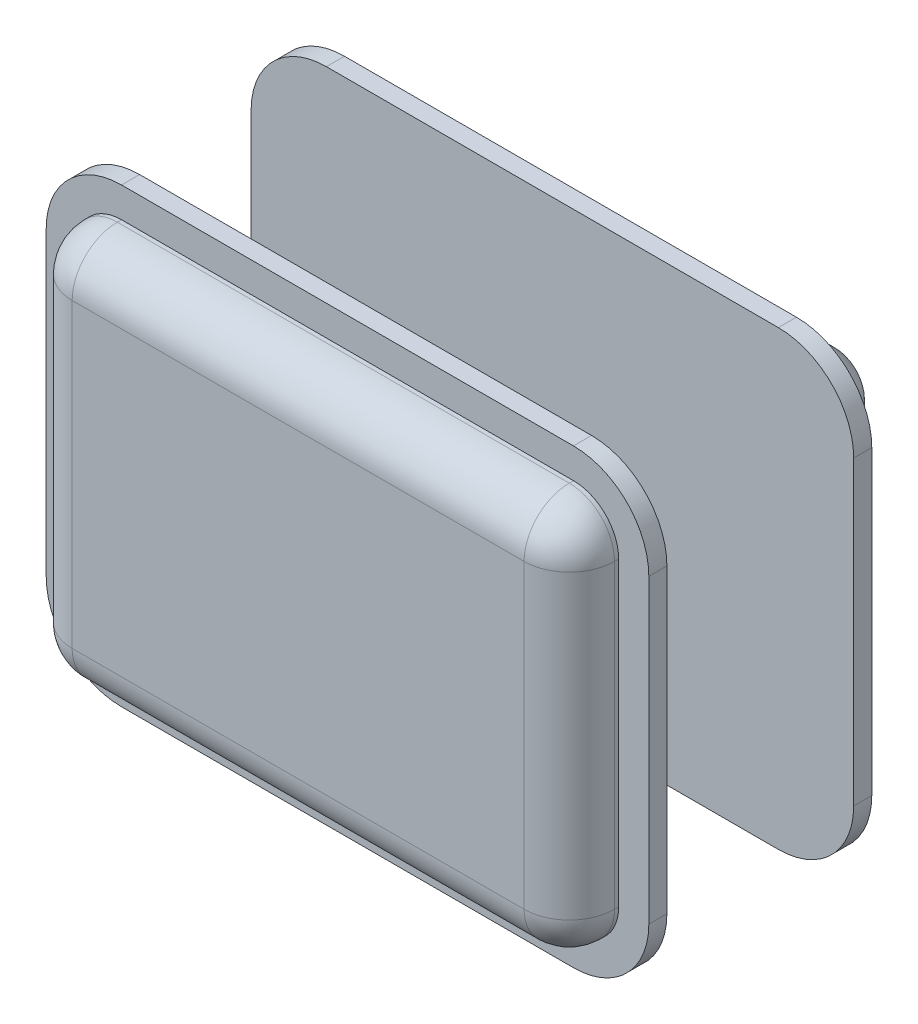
ISO-10303-21;
HEADER;
FILE_DESCRIPTION(('STEP AP214'),'2;1');
FILE_NAME('part.step','',(''),(''),'','','');
FILE_SCHEMA(('AUTOMOTIVE_DESIGN { 1 0 10303 214 1 1 1 1 }'));
ENDSEC;
DATA;
#1=APPLICATION_CONTEXT('core data for automotive mechanical design processes');
#2=APPLICATION_PROTOCOL_DEFINITION('international standard','automotive_design',2000,#1);
#3=PRODUCT_CONTEXT('',#1,'mechanical');
#4=PRODUCT('Part','Part','',(#3));
#5=PRODUCT_RELATED_PRODUCT_CATEGORY('part','',(#4));
#6=PRODUCT_DEFINITION_FORMATION('','',#4);
#7=PRODUCT_DEFINITION_CONTEXT('part definition',#1,'design');
#8=PRODUCT_DEFINITION('design','',#6,#7);
#9=PRODUCT_DEFINITION_SHAPE('','',#8);
#10=(LENGTH_UNIT() NAMED_UNIT(*) SI_UNIT(.MILLI.,.METRE.));
#11=(NAMED_UNIT(*) PLANE_ANGLE_UNIT() SI_UNIT($,.RADIAN.));
#12=(NAMED_UNIT(*) SI_UNIT($,.STERADIAN.) SOLID_ANGLE_UNIT());
#13=UNCERTAINTY_MEASURE_WITH_UNIT(LENGTH_MEASURE(1.E-05),#10,'distance_accuracy_value','');
#14=(GEOMETRIC_REPRESENTATION_CONTEXT(3) GLOBAL_UNCERTAINTY_ASSIGNED_CONTEXT((#13)) GLOBAL_UNIT_ASSIGNED_CONTEXT((#10,
#11,#12)) REPRESENTATION_CONTEXT('',''));
#15=CARTESIAN_POINT('',(0.,0.,0.));
#16=DIRECTION('',(0.,0.,1.));
#17=DIRECTION('',(1.,0.,0.));
#18=AXIS2_PLACEMENT_3D('',#15,#16,#17);
#19=CARTESIAN_POINT('',(0.,0.,31.));
#20=DIRECTION('',(0.,0.,-1.));
#21=DIRECTION('',(-1.,0.,0.));
#22=AXIS2_PLACEMENT_3D('',#19,#20,#21);
#23=CYLINDRICAL_SURFACE('',#22,7.);
#24=CARTESIAN_POINT('',(0.,0.,31.));
#25=DIRECTION('',(0.,0.,1.));
#26=DIRECTION('',(1.,0.,0.));
#27=AXIS2_PLACEMENT_3D('',#24,#25,#26);
#28=CIRCLE('',#27,7.);
#29=CARTESIAN_POINT('',(7.,0.,31.));
#30=VERTEX_POINT('',#29);
#31=EDGE_CURVE('E565',#30,#30,#28,.F.);
#32=ORIENTED_EDGE('',*,*,#31,.T.);
#33=EDGE_LOOP('',(#32));
#34=FACE_BOUND('',#33,.T.);
#35=CARTESIAN_POINT('',(0.,0.,11.));
#36=DIRECTION('',(0.,0.,-1.));
#37=DIRECTION('',(-1.,0.,0.));
#38=AXIS2_PLACEMENT_3D('',#35,#36,#37);
#39=CIRCLE('',#38,7.);
#40=CARTESIAN_POINT('',(-7.,0.,11.));
#41=VERTEX_POINT('',#40);
#42=EDGE_CURVE('E597',#41,#41,#39,.T.);
#43=ORIENTED_EDGE('',*,*,#42,.F.);
#44=EDGE_LOOP('',(#43));
#45=FACE_BOUND('',#44,.T.);
#46=ADVANCED_FACE('F34',(#34,#45),#23,.T.);
#47=CARTESIAN_POINT('',(115.,-50.,31.));
#48=DIRECTION('',(0.,0.,1.));
#49=DIRECTION('',(1.,0.,0.));
#50=AXIS2_PLACEMENT_3D('',#47,#48,#49);
#51=PLANE('',#50);
#52=CARTESIAN_POINT('',(115.,-50.,31.));
#53=DIRECTION('',(0.,0.,1.));
#54=DIRECTION('',(1.,0.,0.));
#55=AXIS2_PLACEMENT_3D('',#52,#53,#54);
#56=CIRCLE('',#55,25.);
#57=CARTESIAN_POINT('',(115.,-75.,31.));
#58=VERTEX_POINT('',#57);
#59=CARTESIAN_POINT('',(140.,-50.,31.));
#60=VERTEX_POINT('',#59);
#61=EDGE_CURVE('E481',#58,#60,#56,.T.);
#62=ORIENTED_EDGE('',*,*,#61,.F.);
#63=DIRECTION('',(1.,0.,0.));
#64=VECTOR('',#63,1.);
#65=CARTESIAN_POINT('',(-34.9999999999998,-75.,31.));
#66=LINE('',#65,#64);
#67=CARTESIAN_POINT('',(-34.9999999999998,-75.,31.));
#68=VERTEX_POINT('',#67);
#69=EDGE_CURVE('E486',#68,#58,#66,.T.);
#70=ORIENTED_EDGE('',*,*,#69,.F.);
#71=CARTESIAN_POINT('',(-35.,-50.,31.));
#72=DIRECTION('',(0.,0.,1.));
#73=DIRECTION('',(1.,0.,0.));
#74=AXIS2_PLACEMENT_3D('',#71,#72,#73);
#75=CIRCLE('',#74,25.);
#76=CARTESIAN_POINT('',(-60.,-49.9999999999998,31.));
#77=VERTEX_POINT('',#76);
#78=EDGE_CURVE('E513',#77,#68,#75,.T.);
#79=ORIENTED_EDGE('',*,*,#78,.F.);
#80=DIRECTION('',(0.,-1.,0.));
#81=VECTOR('',#80,1.);
#82=CARTESIAN_POINT('',(-60.,49.9999999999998,31.));
#83=LINE('',#82,#81);
#84=CARTESIAN_POINT('',(-60.,49.9999999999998,31.));
#85=VERTEX_POINT('',#84);
#86=EDGE_CURVE('E511',#85,#77,#83,.T.);
#87=ORIENTED_EDGE('',*,*,#86,.F.);
#88=CARTESIAN_POINT('',(-35.,50.,31.));
#89=DIRECTION('',(0.,0.,1.));
#90=DIRECTION('',(1.,0.,0.));
#91=AXIS2_PLACEMENT_3D('',#88,#89,#90);
#92=CIRCLE('',#91,25.);
#93=CARTESIAN_POINT('',(-34.9999999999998,75.,31.));
#94=VERTEX_POINT('',#93);
#95=EDGE_CURVE('E509',#94,#85,#92,.T.);
#96=ORIENTED_EDGE('',*,*,#95,.F.);
#97=DIRECTION('',(-1.,0.,0.));
#98=VECTOR('',#97,1.);
#99=CARTESIAN_POINT('',(-34.9999999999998,75.,31.));
#100=LINE('',#99,#98);
#101=CARTESIAN_POINT('',(115.,75.,31.));
#102=VERTEX_POINT('',#101);
#103=EDGE_CURVE('E507',#102,#94,#100,.T.);
#104=ORIENTED_EDGE('',*,*,#103,.F.);
#105=CARTESIAN_POINT('',(115.,50.,31.));
#106=DIRECTION('',(0.,0.,1.));
#107=DIRECTION('',(-1.,0.,0.));
#108=AXIS2_PLACEMENT_3D('',#105,#106,#107);
#109=CIRCLE('',#108,25.);
#110=CARTESIAN_POINT('',(140.,50.,31.));
#111=VERTEX_POINT('',#110);
#112=EDGE_CURVE('E505',#111,#102,#109,.T.);
#113=ORIENTED_EDGE('',*,*,#112,.F.);
#114=DIRECTION('',(0.,1.,0.));
#115=VECTOR('',#114,1.);
#116=CARTESIAN_POINT('',(140.,50.,31.));
#117=LINE('',#116,#115);
#118=EDGE_CURVE('E503',#60,#111,#117,.T.);
#119=ORIENTED_EDGE('',*,*,#118,.F.);
#120=EDGE_LOOP('',(#62,#70,#79,#87,#96,#104,#113,#119));
#121=FACE_BOUND('',#120,.T.);
#122=ORIENTED_EDGE('',*,*,#31,.F.);
#123=EDGE_LOOP('',(#122));
#124=FACE_BOUND('',#123,.T.);
#125=ADVANCED_FACE('F697',(#121,#124),#51,.F.);
#126=CARTESIAN_POINT('',(115.,-50.,37.));
#127=DIRECTION('',(0.,0.,1.));
#128=DIRECTION('',(1.,0.,0.));
#129=AXIS2_PLACEMENT_3D('',#126,#127,#128);
#130=PLANE('',#129);
#131=CARTESIAN_POINT('',(115.,-50.,37.));
#132=DIRECTION('',(0.,0.,1.));
#133=DIRECTION('',(1.,0.,0.));
#134=AXIS2_PLACEMENT_3D('',#131,#132,#133);
#135=CIRCLE('',#134,25.);
#136=CARTESIAN_POINT('',(115.,-75.,37.));
#137=VERTEX_POINT('',#136);
#138=CARTESIAN_POINT('',(140.,-50.,37.));
#139=VERTEX_POINT('',#138);
#140=EDGE_CURVE('E482',#137,#139,#135,.T.);
#141=ORIENTED_EDGE('',*,*,#140,.T.);
#142=DIRECTION('',(0.,1.,0.));
#143=VECTOR('',#142,1.);
#144=CARTESIAN_POINT('',(140.,50.,37.));
#145=LINE('',#144,#143);
#146=CARTESIAN_POINT('',(140.,50.,37.));
#147=VERTEX_POINT('',#146);
#148=EDGE_CURVE('E485',#139,#147,#145,.T.);
#149=ORIENTED_EDGE('',*,*,#148,.T.);
#150=CARTESIAN_POINT('',(115.,50.,37.));
#151=DIRECTION('',(0.,0.,1.));
#152=DIRECTION('',(-1.,0.,0.));
#153=AXIS2_PLACEMENT_3D('',#150,#151,#152);
#154=CIRCLE('',#153,25.);
#155=CARTESIAN_POINT('',(115.,75.,37.));
#156=VERTEX_POINT('',#155);
#157=EDGE_CURVE('E488',#147,#156,#154,.T.);
#158=ORIENTED_EDGE('',*,*,#157,.T.);
#159=DIRECTION('',(-1.,0.,0.));
#160=VECTOR('',#159,1.);
#161=CARTESIAN_POINT('',(-34.9999999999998,75.,37.));
#162=LINE('',#161,#160);
#163=CARTESIAN_POINT('',(-34.9999999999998,75.,37.));
#164=VERTEX_POINT('',#163);
#165=EDGE_CURVE('E490',#156,#164,#162,.T.);
#166=ORIENTED_EDGE('',*,*,#165,.T.);
#167=CARTESIAN_POINT('',(-35.,50.,37.));
#168=DIRECTION('',(0.,0.,1.));
#169=DIRECTION('',(1.,0.,0.));
#170=AXIS2_PLACEMENT_3D('',#167,#168,#169);
#171=CIRCLE('',#170,25.);
#172=CARTESIAN_POINT('',(-60.,49.9999999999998,37.));
#173=VERTEX_POINT('',#172);
#174=EDGE_CURVE('E492',#164,#173,#171,.T.);
#175=ORIENTED_EDGE('',*,*,#174,.T.);
#176=DIRECTION('',(0.,-1.,0.));
#177=VECTOR('',#176,1.);
#178=CARTESIAN_POINT('',(-60.,49.9999999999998,37.));
#179=LINE('',#178,#177);
#180=CARTESIAN_POINT('',(-60.,-49.9999999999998,37.));
#181=VERTEX_POINT('',#180);
#182=EDGE_CURVE('E494',#173,#181,#179,.T.);
#183=ORIENTED_EDGE('',*,*,#182,.T.);
#184=CARTESIAN_POINT('',(-35.,-50.,37.));
#185=DIRECTION('',(0.,0.,1.));
#186=DIRECTION('',(1.,0.,0.));
#187=AXIS2_PLACEMENT_3D('',#184,#185,#186);
#188=CIRCLE('',#187,25.);
#189=CARTESIAN_POINT('',(-34.9999999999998,-75.,37.));
#190=VERTEX_POINT('',#189);
#191=EDGE_CURVE('E496',#181,#190,#188,.T.);
#192=ORIENTED_EDGE('',*,*,#191,.T.);
#193=DIRECTION('',(1.,0.,0.));
#194=VECTOR('',#193,1.);
#195=CARTESIAN_POINT('',(-34.9999999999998,-75.,37.));
#196=LINE('',#195,#194);
#197=EDGE_CURVE('E498',#190,#137,#196,.T.);
#198=ORIENTED_EDGE('',*,*,#197,.T.);
#199=EDGE_LOOP('',(#141,#149,#158,#166,#175,#183,#192,#198));
#200=FACE_BOUND('',#199,.T.);
#201=DIRECTION('',(0.,1.,0.));
#202=VECTOR('',#201,1.);
#203=CARTESIAN_POINT('',(130.,-50.,37.));
#204=LINE('',#203,#202);
#205=CARTESIAN_POINT('',(130.,-50.,37.));
#206=VERTEX_POINT('',#205);
#207=CARTESIAN_POINT('',(130.,50.,37.));
#208=VERTEX_POINT('',#207);
#209=EDGE_CURVE('E443',#206,#208,#204,.T.);
#210=ORIENTED_EDGE('',*,*,#209,.F.);
#211=CARTESIAN_POINT('',(115.,-50.,37.));
#212=DIRECTION('',(0.,0.,1.));
#213=DIRECTION('',(1.,0.,0.));
#214=AXIS2_PLACEMENT_3D('',#211,#212,#213);
#215=CIRCLE('',#214,15.);
#216=CARTESIAN_POINT('',(115.,-65.,37.));
#217=VERTEX_POINT('',#216);
#218=EDGE_CURVE('E440',#217,#206,#215,.T.);
#219=ORIENTED_EDGE('',*,*,#218,.F.);
#220=DIRECTION('',(1.,0.,0.));
#221=VECTOR('',#220,1.);
#222=CARTESIAN_POINT('',(-34.9999999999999,-65.,37.));
#223=LINE('',#222,#221);
#224=CARTESIAN_POINT('',(-34.9999999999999,-65.,37.));
#225=VERTEX_POINT('',#224);
#226=EDGE_CURVE('E462',#225,#217,#223,.T.);
#227=ORIENTED_EDGE('',*,*,#226,.F.);
#228=CARTESIAN_POINT('',(-35.,-50.,37.));
#229=DIRECTION('',(0.,0.,1.));
#230=DIRECTION('',(1.,0.,0.));
#231=AXIS2_PLACEMENT_3D('',#228,#229,#230);
#232=CIRCLE('',#231,15.);
#233=CARTESIAN_POINT('',(-50.,-49.9999999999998,37.));
#234=VERTEX_POINT('',#233);
#235=EDGE_CURVE('E459',#234,#225,#232,.T.);
#236=ORIENTED_EDGE('',*,*,#235,.F.);
#237=DIRECTION('',(0.,-1.,0.));
#238=VECTOR('',#237,1.);
#239=CARTESIAN_POINT('',(-50.,49.9999999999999,37.));
#240=LINE('',#239,#238);
#241=CARTESIAN_POINT('',(-50.,49.9999999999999,37.));
#242=VERTEX_POINT('',#241);
#243=EDGE_CURVE('E456',#242,#234,#240,.T.);
#244=ORIENTED_EDGE('',*,*,#243,.F.);
#245=CARTESIAN_POINT('',(-35.,50.,37.));
#246=DIRECTION('',(0.,0.,1.));
#247=DIRECTION('',(1.,0.,0.));
#248=AXIS2_PLACEMENT_3D('',#245,#246,#247);
#249=CIRCLE('',#248,15.);
#250=CARTESIAN_POINT('',(-34.9999999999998,65.,37.));
#251=VERTEX_POINT('',#250);
#252=EDGE_CURVE('E453',#251,#242,#249,.T.);
#253=ORIENTED_EDGE('',*,*,#252,.F.);
#254=DIRECTION('',(-1.,0.,0.));
#255=VECTOR('',#254,1.);
#256=CARTESIAN_POINT('',(115.,65.,37.));
#257=LINE('',#256,#255);
#258=CARTESIAN_POINT('',(115.,65.,37.));
#259=VERTEX_POINT('',#258);
#260=EDGE_CURVE('E450',#259,#251,#257,.T.);
#261=ORIENTED_EDGE('',*,*,#260,.F.);
#262=CARTESIAN_POINT('',(115.,50.,37.));
#263=DIRECTION('',(0.,0.,1.));
#264=DIRECTION('',(1.,0.,0.));
#265=AXIS2_PLACEMENT_3D('',#262,#263,#264);
#266=CIRCLE('',#265,15.);
#267=EDGE_CURVE('E447',#208,#259,#266,.T.);
#268=ORIENTED_EDGE('',*,*,#267,.F.);
#269=EDGE_LOOP('',(#210,#219,#227,#236,#244,#253,#261,#268));
#270=FACE_BOUND('',#269,.T.);
#271=ADVANCED_FACE('F704',(#200,#270),#130,.T.);
#272=CARTESIAN_POINT('',(115.,-50.,37.));
#273=DIRECTION('',(0.,0.,-1.));
#274=DIRECTION('',(-1.,0.,0.));
#275=AXIS2_PLACEMENT_3D('',#272,#273,#274);
#276=CYLINDRICAL_SURFACE('',#275,25.);
#277=ORIENTED_EDGE('',*,*,#61,.T.);
#278=DIRECTION('',(0.,0.,-1.));
#279=VECTOR('',#278,1.);
#280=CARTESIAN_POINT('',(140.,-50.,37.));
#281=LINE('',#280,#279);
#282=EDGE_CURVE('E536',#139,#60,#281,.T.);
#283=ORIENTED_EDGE('',*,*,#282,.F.);
#284=ORIENTED_EDGE('',*,*,#140,.F.);
#285=DIRECTION('',(0.,0.,-1.));
#286=VECTOR('',#285,1.);
#287=CARTESIAN_POINT('',(115.,-75.,37.));
#288=LINE('',#287,#286);
#289=EDGE_CURVE('E500',#137,#58,#288,.T.);
#290=ORIENTED_EDGE('',*,*,#289,.T.);
#291=EDGE_LOOP('',(#277,#283,#284,#290));
#292=FACE_BOUND('',#291,.T.);
#293=ADVANCED_FACE('F1072',(#292),#276,.T.);
#294=CARTESIAN_POINT('',(140.,50.,37.));
#295=DIRECTION('',(-1.,0.,0.));
#296=DIRECTION('',(0.,0.,1.));
#297=AXIS2_PLACEMENT_3D('',#294,#295,#296);
#298=PLANE('',#297);
#299=ORIENTED_EDGE('',*,*,#118,.T.);
#300=DIRECTION('',(0.,0.,-1.));
#301=VECTOR('',#300,1.);
#302=CARTESIAN_POINT('',(140.,50.,37.));
#303=LINE('',#302,#301);
#304=EDGE_CURVE('E533',#147,#111,#303,.T.);
#305=ORIENTED_EDGE('',*,*,#304,.F.);
#306=ORIENTED_EDGE('',*,*,#148,.F.);
#307=ORIENTED_EDGE('',*,*,#282,.T.);
#308=EDGE_LOOP('',(#299,#305,#306,#307));
#309=FACE_BOUND('',#308,.T.);
#310=ADVANCED_FACE('F1075',(#309),#298,.F.);
#311=CARTESIAN_POINT('',(115.,50.,37.));
#312=DIRECTION('',(0.,0.,-1.));
#313=DIRECTION('',(-1.,0.,0.));
#314=AXIS2_PLACEMENT_3D('',#311,#312,#313);
#315=CYLINDRICAL_SURFACE('',#314,25.);
#316=ORIENTED_EDGE('',*,*,#112,.T.);
#317=DIRECTION('',(0.,0.,-1.));
#318=VECTOR('',#317,1.);
#319=CARTESIAN_POINT('',(115.,75.,37.));
#320=LINE('',#319,#318);
#321=EDGE_CURVE('E530',#156,#102,#320,.T.);
#322=ORIENTED_EDGE('',*,*,#321,.F.);
#323=ORIENTED_EDGE('',*,*,#157,.F.);
#324=ORIENTED_EDGE('',*,*,#304,.T.);
#325=EDGE_LOOP('',(#316,#322,#323,#324));
#326=FACE_BOUND('',#325,.T.);
#327=ADVANCED_FACE('F1079',(#326),#315,.T.);
#328=CARTESIAN_POINT('',(-34.9999999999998,75.,37.));
#329=DIRECTION('',(0.,-1.,0.));
#330=DIRECTION('',(1.,0.,0.));
#331=AXIS2_PLACEMENT_3D('',#328,#329,#330);
#332=PLANE('',#331);
#333=ORIENTED_EDGE('',*,*,#103,.T.);
#334=DIRECTION('',(0.,0.,-1.));
#335=VECTOR('',#334,1.);
#336=CARTESIAN_POINT('',(-34.9999999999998,75.,37.));
#337=LINE('',#336,#335);
#338=EDGE_CURVE('E527',#164,#94,#337,.T.);
#339=ORIENTED_EDGE('',*,*,#338,.F.);
#340=ORIENTED_EDGE('',*,*,#165,.F.);
#341=ORIENTED_EDGE('',*,*,#321,.T.);
#342=EDGE_LOOP('',(#333,#339,#340,#341));
#343=FACE_BOUND('',#342,.T.);
#344=ADVANCED_FACE('F1083',(#343),#332,.F.);
#345=CARTESIAN_POINT('',(-35.,50.,37.));
#346=DIRECTION('',(0.,0.,-1.));
#347=DIRECTION('',(-1.,0.,0.));
#348=AXIS2_PLACEMENT_3D('',#345,#346,#347);
#349=CYLINDRICAL_SURFACE('',#348,25.);
#350=ORIENTED_EDGE('',*,*,#95,.T.);
#351=DIRECTION('',(0.,0.,-1.));
#352=VECTOR('',#351,1.);
#353=CARTESIAN_POINT('',(-60.,49.9999999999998,37.));
#354=LINE('',#353,#352);
#355=EDGE_CURVE('E524',#173,#85,#354,.T.);
#356=ORIENTED_EDGE('',*,*,#355,.F.);
#357=ORIENTED_EDGE('',*,*,#174,.F.);
#358=ORIENTED_EDGE('',*,*,#338,.T.);
#359=EDGE_LOOP('',(#350,#356,#357,#358));
#360=FACE_BOUND('',#359,.T.);
#361=ADVANCED_FACE('F1087',(#360),#349,.T.);
#362=CARTESIAN_POINT('',(-60.,49.9999999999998,37.));
#363=DIRECTION('',(1.,0.,0.));
#364=DIRECTION('',(0.,1.,0.));
#365=AXIS2_PLACEMENT_3D('',#362,#363,#364);
#366=PLANE('',#365);
#367=ORIENTED_EDGE('',*,*,#86,.T.);
#368=DIRECTION('',(0.,0.,-1.));
#369=VECTOR('',#368,1.);
#370=CARTESIAN_POINT('',(-60.,-49.9999999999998,37.));
#371=LINE('',#370,#369);
#372=EDGE_CURVE('E521',#181,#77,#371,.T.);
#373=ORIENTED_EDGE('',*,*,#372,.F.);
#374=ORIENTED_EDGE('',*,*,#182,.F.);
#375=ORIENTED_EDGE('',*,*,#355,.T.);
#376=EDGE_LOOP('',(#367,#373,#374,#375));
#377=FACE_BOUND('',#376,.T.);
#378=ADVANCED_FACE('F1091',(#377),#366,.F.);
#379=CARTESIAN_POINT('',(-35.,-50.,37.));
#380=DIRECTION('',(0.,0.,-1.));
#381=DIRECTION('',(-1.,0.,0.));
#382=AXIS2_PLACEMENT_3D('',#379,#380,#381);
#383=CYLINDRICAL_SURFACE('',#382,25.);
#384=ORIENTED_EDGE('',*,*,#78,.T.);
#385=DIRECTION('',(0.,0.,-1.));
#386=VECTOR('',#385,1.);
#387=CARTESIAN_POINT('',(-34.9999999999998,-75.,37.));
#388=LINE('',#387,#386);
#389=EDGE_CURVE('E518',#190,#68,#388,.T.);
#390=ORIENTED_EDGE('',*,*,#389,.F.);
#391=ORIENTED_EDGE('',*,*,#191,.F.);
#392=ORIENTED_EDGE('',*,*,#372,.T.);
#393=EDGE_LOOP('',(#384,#390,#391,#392));
#394=FACE_BOUND('',#393,.T.);
#395=ADVANCED_FACE('F1095',(#394),#383,.T.);
#396=CARTESIAN_POINT('',(-34.9999999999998,-75.,37.));
#397=DIRECTION('',(0.,1.,0.));
#398=DIRECTION('',(-1.,0.,0.));
#399=AXIS2_PLACEMENT_3D('',#396,#397,#398);
#400=PLANE('',#399);
#401=ORIENTED_EDGE('',*,*,#69,.T.);
#402=ORIENTED_EDGE('',*,*,#289,.F.);
#403=ORIENTED_EDGE('',*,*,#197,.F.);
#404=ORIENTED_EDGE('',*,*,#389,.T.);
#405=EDGE_LOOP('',(#401,#402,#403,#404));
#406=FACE_BOUND('',#405,.T.);
#407=ADVANCED_FACE('F1099',(#406),#400,.F.);
#408=CARTESIAN_POINT('',(115.,-50.,53.4));
#409=DIRECTION('',(0.,0.,-1.));
#410=DIRECTION('',(-1.,0.,0.));
#411=AXIS2_PLACEMENT_3D('',#408,#409,#410);
#412=CYLINDRICAL_SURFACE('',#411,15.);
#413=DIRECTION('',(0.,0.,-1.));
#414=VECTOR('',#413,1.);
#415=CARTESIAN_POINT('',(130.,-50.,53.4));
#416=LINE('',#415,#414);
#417=CARTESIAN_POINT('',(130.,-50.,38.4));
#418=VERTEX_POINT('',#417);
#419=EDGE_CURVE('E479',#418,#206,#416,.T.);
#420=ORIENTED_EDGE('',*,*,#419,.F.);
#421=CARTESIAN_POINT('',(115.,-50.,38.4));
#422=DIRECTION('',(0.,0.,-1.));
#423=DIRECTION('',(-1.,0.,0.));
#424=AXIS2_PLACEMENT_3D('',#421,#422,#423);
#425=CIRCLE('',#424,15.);
#426=CARTESIAN_POINT('',(115.,-65.,38.4));
#427=VERTEX_POINT('',#426);
#428=EDGE_CURVE('E563',#418,#427,#425,.T.);
#429=ORIENTED_EDGE('',*,*,#428,.T.);
#430=DIRECTION('',(0.,0.,-1.));
#431=VECTOR('',#430,1.);
#432=CARTESIAN_POINT('',(115.,-65.,53.4));
#433=LINE('',#432,#431);
#434=EDGE_CURVE('E465',#427,#217,#433,.T.);
#435=ORIENTED_EDGE('',*,*,#434,.T.);
#436=ORIENTED_EDGE('',*,*,#218,.T.);
#437=EDGE_LOOP('',(#420,#429,#435,#436));
#438=FACE_BOUND('',#437,.T.);
#439=ADVANCED_FACE('F1102',(#438),#412,.T.);
#440=CARTESIAN_POINT('',(130.,-50.,53.4));
#441=DIRECTION('',(-1.,0.,0.));
#442=DIRECTION('',(0.,0.,1.));
#443=AXIS2_PLACEMENT_3D('',#440,#441,#442);
#444=PLANE('',#443);
#445=DIRECTION('',(0.,0.,-1.));
#446=VECTOR('',#445,1.);
#447=CARTESIAN_POINT('',(130.,50.,53.4));
#448=LINE('',#447,#446);
#449=CARTESIAN_POINT('',(130.,50.,38.4));
#450=VERTEX_POINT('',#449);
#451=EDGE_CURVE('E477',#450,#208,#448,.T.);
#452=ORIENTED_EDGE('',*,*,#451,.F.);
#453=DIRECTION('',(0.,1.,0.));
#454=VECTOR('',#453,1.);
#455=CARTESIAN_POINT('',(130.,-50.,38.4));
#456=LINE('',#455,#454);
#457=EDGE_CURVE('E561',#450,#418,#456,.F.);
#458=ORIENTED_EDGE('',*,*,#457,.T.);
#459=ORIENTED_EDGE('',*,*,#419,.T.);
#460=ORIENTED_EDGE('',*,*,#209,.T.);
#461=EDGE_LOOP('',(#452,#458,#459,#460));
#462=FACE_BOUND('',#461,.T.);
#463=ADVANCED_FACE('F1110',(#462),#444,.F.);
#464=CARTESIAN_POINT('',(115.,50.,53.4));
#465=DIRECTION('',(0.,0.,-1.));
#466=DIRECTION('',(-1.,0.,0.));
#467=AXIS2_PLACEMENT_3D('',#464,#465,#466);
#468=CYLINDRICAL_SURFACE('',#467,15.);
#469=DIRECTION('',(0.,0.,-1.));
#470=VECTOR('',#469,1.);
#471=CARTESIAN_POINT('',(115.,65.,53.4));
#472=LINE('',#471,#470);
#473=CARTESIAN_POINT('',(115.,65.,38.4));
#474=VERTEX_POINT('',#473);
#475=EDGE_CURVE('E475',#474,#259,#472,.T.);
#476=ORIENTED_EDGE('',*,*,#475,.F.);
#477=CARTESIAN_POINT('',(115.,50.,38.4));
#478=DIRECTION('',(0.,0.,-1.));
#479=DIRECTION('',(-1.,0.,0.));
#480=AXIS2_PLACEMENT_3D('',#477,#478,#479);
#481=CIRCLE('',#480,15.);
#482=EDGE_CURVE('E559',#474,#450,#481,.T.);
#483=ORIENTED_EDGE('',*,*,#482,.T.);
#484=ORIENTED_EDGE('',*,*,#451,.T.);
#485=ORIENTED_EDGE('',*,*,#267,.T.);
#486=EDGE_LOOP('',(#476,#483,#484,#485));
#487=FACE_BOUND('',#486,.T.);
#488=ADVANCED_FACE('F1114',(#487),#468,.T.);
#489=CARTESIAN_POINT('',(115.,65.,53.4));
#490=DIRECTION('',(0.,-1.,0.));
#491=DIRECTION('',(1.,0.,0.));
#492=AXIS2_PLACEMENT_3D('',#489,#490,#491);
#493=PLANE('',#492);
#494=DIRECTION('',(0.,0.,-1.));
#495=VECTOR('',#494,1.);
#496=CARTESIAN_POINT('',(-34.9999999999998,65.,53.4));
#497=LINE('',#496,#495);
#498=CARTESIAN_POINT('',(-34.9999999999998,65.,38.4));
#499=VERTEX_POINT('',#498);
#500=EDGE_CURVE('E473',#499,#251,#497,.T.);
#501=ORIENTED_EDGE('',*,*,#500,.F.);
#502=DIRECTION('',(-1.,0.,0.));
#503=VECTOR('',#502,1.);
#504=CARTESIAN_POINT('',(115.,65.,38.4));
#505=LINE('',#504,#503);
#506=EDGE_CURVE('E557',#499,#474,#505,.F.);
#507=ORIENTED_EDGE('',*,*,#506,.T.);
#508=ORIENTED_EDGE('',*,*,#475,.T.);
#509=ORIENTED_EDGE('',*,*,#260,.T.);
#510=EDGE_LOOP('',(#501,#507,#508,#509));
#511=FACE_BOUND('',#510,.T.);
#512=ADVANCED_FACE('F1118',(#511),#493,.F.);
#513=CARTESIAN_POINT('',(-35.,50.,53.4));
#514=DIRECTION('',(0.,0.,-1.));
#515=DIRECTION('',(-1.,0.,0.));
#516=AXIS2_PLACEMENT_3D('',#513,#514,#515);
#517=CYLINDRICAL_SURFACE('',#516,15.);
#518=DIRECTION('',(0.,0.,-1.));
#519=VECTOR('',#518,1.);
#520=CARTESIAN_POINT('',(-50.,49.9999999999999,53.4));
#521=LINE('',#520,#519);
#522=CARTESIAN_POINT('',(-50.,49.9999999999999,38.4));
#523=VERTEX_POINT('',#522);
#524=EDGE_CURVE('E471',#523,#242,#521,.T.);
#525=ORIENTED_EDGE('',*,*,#524,.F.);
#526=CARTESIAN_POINT('',(-35.,50.,38.4));
#527=DIRECTION('',(0.,0.,-1.));
#528=DIRECTION('',(-1.,0.,0.));
#529=AXIS2_PLACEMENT_3D('',#526,#527,#528);
#530=CIRCLE('',#529,15.);
#531=EDGE_CURVE('E555',#523,#499,#530,.T.);
#532=ORIENTED_EDGE('',*,*,#531,.T.);
#533=ORIENTED_EDGE('',*,*,#500,.T.);
#534=ORIENTED_EDGE('',*,*,#252,.T.);
#535=EDGE_LOOP('',(#525,#532,#533,#534));
#536=FACE_BOUND('',#535,.T.);
#537=ADVANCED_FACE('F1122',(#536),#517,.T.);
#538=CARTESIAN_POINT('',(-50.,49.9999999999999,53.4));
#539=DIRECTION('',(1.,0.,0.));
#540=DIRECTION('',(0.,1.,0.));
#541=AXIS2_PLACEMENT_3D('',#538,#539,#540);
#542=PLANE('',#541);
#543=DIRECTION('',(0.,0.,-1.));
#544=VECTOR('',#543,1.);
#545=CARTESIAN_POINT('',(-50.,-49.9999999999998,53.4));
#546=LINE('',#545,#544);
#547=CARTESIAN_POINT('',(-50.,-49.9999999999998,38.4));
#548=VERTEX_POINT('',#547);
#549=EDGE_CURVE('E469',#548,#234,#546,.T.);
#550=ORIENTED_EDGE('',*,*,#549,.F.);
#551=DIRECTION('',(0.,-1.,0.));
#552=VECTOR('',#551,1.);
#553=CARTESIAN_POINT('',(-50.,49.9999999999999,38.4));
#554=LINE('',#553,#552);
#555=EDGE_CURVE('E553',#548,#523,#554,.F.);
#556=ORIENTED_EDGE('',*,*,#555,.T.);
#557=ORIENTED_EDGE('',*,*,#524,.T.);
#558=ORIENTED_EDGE('',*,*,#243,.T.);
#559=EDGE_LOOP('',(#550,#556,#557,#558));
#560=FACE_BOUND('',#559,.T.);
#561=ADVANCED_FACE('F1126',(#560),#542,.F.);
#562=CARTESIAN_POINT('',(-35.,-50.,53.4));
#563=DIRECTION('',(0.,0.,-1.));
#564=DIRECTION('',(-1.,0.,0.));
#565=AXIS2_PLACEMENT_3D('',#562,#563,#564);
#566=CYLINDRICAL_SURFACE('',#565,15.);
#567=DIRECTION('',(0.,0.,-1.));
#568=VECTOR('',#567,1.);
#569=CARTESIAN_POINT('',(-34.9999999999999,-65.,53.4));
#570=LINE('',#569,#568);
#571=CARTESIAN_POINT('',(-34.9999999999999,-65.,38.4));
#572=VERTEX_POINT('',#571);
#573=EDGE_CURVE('E467',#572,#225,#570,.T.);
#574=ORIENTED_EDGE('',*,*,#573,.F.);
#575=CARTESIAN_POINT('',(-35.,-50.,38.4));
#576=DIRECTION('',(0.,0.,-1.));
#577=DIRECTION('',(-1.,0.,0.));
#578=AXIS2_PLACEMENT_3D('',#575,#576,#577);
#579=CIRCLE('',#578,15.);
#580=EDGE_CURVE('E551',#572,#548,#579,.T.);
#581=ORIENTED_EDGE('',*,*,#580,.T.);
#582=ORIENTED_EDGE('',*,*,#549,.T.);
#583=ORIENTED_EDGE('',*,*,#235,.T.);
#584=EDGE_LOOP('',(#574,#581,#582,#583));
#585=FACE_BOUND('',#584,.T.);
#586=ADVANCED_FACE('F1130',(#585),#566,.T.);
#587=CARTESIAN_POINT('',(-34.9999999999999,-65.,53.4));
#588=DIRECTION('',(0.,1.,0.));
#589=DIRECTION('',(-1.,0.,0.));
#590=AXIS2_PLACEMENT_3D('',#587,#588,#589);
#591=PLANE('',#590);
#592=ORIENTED_EDGE('',*,*,#434,.F.);
#593=DIRECTION('',(1.,0.,0.));
#594=VECTOR('',#593,1.);
#595=CARTESIAN_POINT('',(-34.9999999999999,-65.,38.4));
#596=LINE('',#595,#594);
#597=EDGE_CURVE('E548',#427,#572,#596,.F.);
#598=ORIENTED_EDGE('',*,*,#597,.T.);
#599=ORIENTED_EDGE('',*,*,#573,.T.);
#600=ORIENTED_EDGE('',*,*,#226,.T.);
#601=EDGE_LOOP('',(#592,#598,#599,#600));
#602=FACE_BOUND('',#601,.T.);
#603=ADVANCED_FACE('F1134',(#602),#591,.F.);
#604=CARTESIAN_POINT('',(115.,-50.,53.4));
#605=DIRECTION('',(0.,0.,1.));
#606=DIRECTION('',(1.,0.,0.));
#607=AXIS2_PLACEMENT_3D('',#604,#605,#606);
#608=PLANE('',#607);
#609=DIRECTION('',(0.,-1.,0.));
#610=VECTOR('',#609,1.);
#611=CARTESIAN_POINT('',(-35.,-49.9999999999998,53.4));
#612=LINE('',#611,#610);
#613=CARTESIAN_POINT('',(-35.,50.,53.4));
#614=VERTEX_POINT('',#613);
#615=CARTESIAN_POINT('',(-35.,-50.,53.4));
#616=VERTEX_POINT('',#615);
#617=EDGE_CURVE('E543',#614,#616,#612,.T.);
#618=ORIENTED_EDGE('',*,*,#617,.T.);
#619=DIRECTION('',(1.,0.,0.));
#620=VECTOR('',#619,1.);
#621=CARTESIAN_POINT('',(115.,-50.,53.4));
#622=LINE('',#621,#620);
#623=CARTESIAN_POINT('',(115.,-50.,53.4));
#624=VERTEX_POINT('',#623);
#625=EDGE_CURVE('E545',#616,#624,#622,.T.);
#626=ORIENTED_EDGE('',*,*,#625,.T.);
#627=DIRECTION('',(0.,1.,0.));
#628=VECTOR('',#627,1.);
#629=CARTESIAN_POINT('',(115.,50.,53.4));
#630=LINE('',#629,#628);
#631=CARTESIAN_POINT('',(115.,50.,53.4));
#632=VERTEX_POINT('',#631);
#633=EDGE_CURVE('E539',#624,#632,#630,.T.);
#634=ORIENTED_EDGE('',*,*,#633,.T.);
#635=DIRECTION('',(-1.,0.,0.));
#636=VECTOR('',#635,1.);
#637=CARTESIAN_POINT('',(-34.9999999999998,50.,53.4));
#638=LINE('',#637,#636);
#639=EDGE_CURVE('E541',#632,#614,#638,.T.);
#640=ORIENTED_EDGE('',*,*,#639,.T.);
#641=EDGE_LOOP('',(#618,#626,#634,#640));
#642=FACE_BOUND('',#641,.T.);
#643=ADVANCED_FACE('F1044',(#642),#608,.T.);
#644=CARTESIAN_POINT('',(115.,50.,38.4));
#645=DIRECTION('',(1.,0.,0.));
#646=DIRECTION('',(0.,1.,0.));
#647=AXIS2_PLACEMENT_3D('',#644,#645,#646);
#648=CYLINDRICAL_SURFACE('',#647,15.);
#649=CARTESIAN_POINT('',(115.,50.,38.4));
#650=DIRECTION('',(1.,0.,0.));
#651=DIRECTION('',(0.,0.,-1.));
#652=AXIS2_PLACEMENT_3D('',#649,#650,#651);
#653=CIRCLE('',#652,15.);
#654=EDGE_CURVE('E581',#474,#632,#653,.T.);
#655=ORIENTED_EDGE('',*,*,#654,.F.);
#656=ORIENTED_EDGE('',*,*,#506,.F.);
#657=CARTESIAN_POINT('',(-35.,50.,38.4));
#658=DIRECTION('',(-1.,0.,0.));
#659=DIRECTION('',(0.,-1.,0.));
#660=AXIS2_PLACEMENT_3D('',#657,#658,#659);
#661=CIRCLE('',#660,15.);
#662=EDGE_CURVE('E444',#614,#499,#661,.T.);
#663=ORIENTED_EDGE('',*,*,#662,.F.);
#664=ORIENTED_EDGE('',*,*,#639,.F.);
#665=EDGE_LOOP('',(#655,#656,#663,#664));
#666=FACE_BOUND('',#665,.T.);
#667=ADVANCED_FACE('F1040',(#666),#648,.T.);
#668=CARTESIAN_POINT('',(-35.,50.,38.4));
#669=DIRECTION('',(0.,0.,1.));
#670=DIRECTION('',(1.,0.,0.));
#671=AXIS2_PLACEMENT_3D('',#668,#669,#670);
#672=SPHERICAL_SURFACE('',#671,15.);
#673=ORIENTED_EDGE('',*,*,#662,.T.);
#674=ORIENTED_EDGE('',*,*,#531,.F.);
#675=CARTESIAN_POINT('',(-35.,50.,38.4));
#676=DIRECTION('',(0.,-1.,0.));
#677=DIRECTION('',(1.,0.,0.));
#678=AXIS2_PLACEMENT_3D('',#675,#676,#677);
#679=CIRCLE('',#678,15.);
#680=EDGE_CURVE('E578',#614,#523,#679,.T.);
#681=ORIENTED_EDGE('',*,*,#680,.F.);
#682=EDGE_LOOP('',(#673,#674,#681));
#683=FACE_BOUND('',#682,.T.);
#684=ADVANCED_FACE('F1043',(#683),#672,.T.);
#685=CARTESIAN_POINT('',(115.,50.,38.4));
#686=DIRECTION('',(0.,0.,1.));
#687=DIRECTION('',(1.,0.,0.));
#688=AXIS2_PLACEMENT_3D('',#685,#686,#687);
#689=SPHERICAL_SURFACE('',#688,15.);
#690=ORIENTED_EDGE('',*,*,#482,.F.);
#691=ORIENTED_EDGE('',*,*,#654,.T.);
#692=CARTESIAN_POINT('',(115.,50.,38.4));
#693=DIRECTION('',(0.,-1.,0.));
#694=DIRECTION('',(0.,0.,-1.));
#695=AXIS2_PLACEMENT_3D('',#692,#693,#694);
#696=CIRCLE('',#695,15.);
#697=EDGE_CURVE('E575',#450,#632,#696,.T.);
#698=ORIENTED_EDGE('',*,*,#697,.F.);
#699=EDGE_LOOP('',(#690,#691,#698));
#700=FACE_BOUND('',#699,.T.);
#701=ADVANCED_FACE('F1048',(#700),#689,.T.);
#702=CARTESIAN_POINT('',(-35.,-50.,38.4));
#703=DIRECTION('',(0.,1.,0.));
#704=DIRECTION('',(-1.,0.,0.));
#705=AXIS2_PLACEMENT_3D('',#702,#703,#704);
#706=CYLINDRICAL_SURFACE('',#705,15.);
#707=ORIENTED_EDGE('',*,*,#680,.T.);
#708=ORIENTED_EDGE('',*,*,#555,.F.);
#709=CARTESIAN_POINT('',(-35.,-50.,38.4));
#710=DIRECTION('',(0.,-1.,0.));
#711=DIRECTION('',(1.,0.,0.));
#712=AXIS2_PLACEMENT_3D('',#709,#710,#711);
#713=CIRCLE('',#712,15.);
#714=EDGE_CURVE('E572',#616,#548,#713,.T.);
#715=ORIENTED_EDGE('',*,*,#714,.F.);
#716=ORIENTED_EDGE('',*,*,#617,.F.);
#717=EDGE_LOOP('',(#707,#708,#715,#716));
#718=FACE_BOUND('',#717,.T.);
#719=ADVANCED_FACE('F1052',(#718),#706,.T.);
#720=CARTESIAN_POINT('',(115.,-50.,38.4));
#721=DIRECTION('',(0.,-1.,0.));
#722=DIRECTION('',(0.,0.,-1.));
#723=AXIS2_PLACEMENT_3D('',#720,#721,#722);
#724=CYLINDRICAL_SURFACE('',#723,15.);
#725=ORIENTED_EDGE('',*,*,#697,.T.);
#726=ORIENTED_EDGE('',*,*,#633,.F.);
#727=CARTESIAN_POINT('',(115.,-50.,38.4));
#728=DIRECTION('',(0.,-1.,0.));
#729=DIRECTION('',(0.,0.,-1.));
#730=AXIS2_PLACEMENT_3D('',#727,#728,#729);
#731=CIRCLE('',#730,15.);
#732=EDGE_CURVE('E569',#418,#624,#731,.T.);
#733=ORIENTED_EDGE('',*,*,#732,.F.);
#734=ORIENTED_EDGE('',*,*,#457,.F.);
#735=EDGE_LOOP('',(#725,#726,#733,#734));
#736=FACE_BOUND('',#735,.T.);
#737=ADVANCED_FACE('F1056',(#736),#724,.T.);
#738=CARTESIAN_POINT('',(-35.,-50.,38.4));
#739=DIRECTION('',(0.,0.,1.));
#740=DIRECTION('',(1.,0.,0.));
#741=AXIS2_PLACEMENT_3D('',#738,#739,#740);
#742=SPHERICAL_SURFACE('',#741,15.);
#743=ORIENTED_EDGE('',*,*,#714,.T.);
#744=ORIENTED_EDGE('',*,*,#580,.F.);
#745=CARTESIAN_POINT('',(-35.,-50.,38.4));
#746=DIRECTION('',(1.,0.,0.));
#747=DIRECTION('',(0.,1.,0.));
#748=AXIS2_PLACEMENT_3D('',#745,#746,#747);
#749=CIRCLE('',#748,15.);
#750=EDGE_CURVE('E567',#616,#572,#749,.T.);
#751=ORIENTED_EDGE('',*,*,#750,.F.);
#752=EDGE_LOOP('',(#743,#744,#751));
#753=FACE_BOUND('',#752,.T.);
#754=ADVANCED_FACE('F1060',(#753),#742,.T.);
#755=CARTESIAN_POINT('',(115.,-50.,38.4));
#756=DIRECTION('',(0.,0.,1.));
#757=DIRECTION('',(1.,0.,0.));
#758=AXIS2_PLACEMENT_3D('',#755,#756,#757);
#759=SPHERICAL_SURFACE('',#758,15.);
#760=ORIENTED_EDGE('',*,*,#428,.F.);
#761=ORIENTED_EDGE('',*,*,#732,.T.);
#762=CARTESIAN_POINT('',(115.,-50.,38.4));
#763=DIRECTION('',(-1.,0.,0.));
#764=DIRECTION('',(0.,0.,1.));
#765=AXIS2_PLACEMENT_3D('',#762,#763,#764);
#766=CIRCLE('',#765,15.);
#767=EDGE_CURVE('E439',#427,#624,#766,.T.);
#768=ORIENTED_EDGE('',*,*,#767,.F.);
#769=EDGE_LOOP('',(#760,#761,#768));
#770=FACE_BOUND('',#769,.T.);
#771=ADVANCED_FACE('F1064',(#770),#759,.T.);
#772=CARTESIAN_POINT('',(115.,-50.,38.4));
#773=DIRECTION('',(-1.,0.,0.));
#774=DIRECTION('',(0.,-1.,0.));
#775=AXIS2_PLACEMENT_3D('',#772,#773,#774);
#776=CYLINDRICAL_SURFACE('',#775,15.);
#777=ORIENTED_EDGE('',*,*,#750,.T.);
#778=ORIENTED_EDGE('',*,*,#597,.F.);
#779=ORIENTED_EDGE('',*,*,#767,.T.);
#780=ORIENTED_EDGE('',*,*,#625,.F.);
#781=EDGE_LOOP('',(#777,#778,#779,#780));
#782=FACE_BOUND('',#781,.T.);
#783=ADVANCED_FACE('F748',(#782),#776,.T.);
#784=CARTESIAN_POINT('',(-11.,11.,11.));
#785=DIRECTION('',(0.,0.,-1.));
#786=DIRECTION('',(-1.,0.,0.));
#787=AXIS2_PLACEMENT_3D('',#784,#785,#786);
#788=PLANE('',#787);
#789=DIRECTION('',(1.,0.,0.));
#790=VECTOR('',#789,1.);
#791=CARTESIAN_POINT('',(-11.,-11.,11.));
#792=LINE('',#791,#790);
#793=CARTESIAN_POINT('',(-11.,-11.,11.));
#794=VERTEX_POINT('',#793);
#795=CARTESIAN_POINT('',(11.,-11.,11.));
#796=VERTEX_POINT('',#795);
#797=EDGE_CURVE('E417',#794,#796,#792,.T.);
#798=ORIENTED_EDGE('',*,*,#797,.T.);
#799=DIRECTION('',(0.,-1.,0.));
#800=VECTOR('',#799,1.);
#801=CARTESIAN_POINT('',(11.,11.,11.));
#802=LINE('',#801,#800);
#803=CARTESIAN_POINT('',(11.,11.,11.));
#804=VERTEX_POINT('',#803);
#805=EDGE_CURVE('E427',#804,#796,#802,.T.);
#806=ORIENTED_EDGE('',*,*,#805,.F.);
#807=DIRECTION('',(1.,0.,0.));
#808=VECTOR('',#807,1.);
#809=CARTESIAN_POINT('',(-11.,11.,11.));
#810=LINE('',#809,#808);
#811=CARTESIAN_POINT('',(-11.,11.,11.));
#812=VERTEX_POINT('',#811);
#813=EDGE_CURVE('E407',#812,#804,#810,.T.);
#814=ORIENTED_EDGE('',*,*,#813,.F.);
#815=DIRECTION('',(0.,-1.,0.));
#816=VECTOR('',#815,1.);
#817=CARTESIAN_POINT('',(-11.,11.,11.));
#818=LINE('',#817,#816);
#819=EDGE_CURVE('E430',#812,#794,#818,.T.);
#820=ORIENTED_EDGE('',*,*,#819,.T.);
#821=EDGE_LOOP('',(#798,#806,#814,#820));
#822=FACE_BOUND('',#821,.T.);
#823=ORIENTED_EDGE('',*,*,#42,.T.);
#824=EDGE_LOOP('',(#823));
#825=FACE_BOUND('',#824,.T.);
#826=ADVANCED_FACE('F740',(#822,#825),#788,.F.);
#827=CARTESIAN_POINT('',(-11.,11.,-11.));
#828=DIRECTION('',(1.,0.,0.));
#829=DIRECTION('',(0.,0.,-1.));
#830=AXIS2_PLACEMENT_3D('',#827,#828,#829);
#831=PLANE('',#830);
#832=DIRECTION('',(0.,0.,1.));
#833=VECTOR('',#832,1.);
#834=CARTESIAN_POINT('',(-11.,-11.,-11.));
#835=LINE('',#834,#833);
#836=CARTESIAN_POINT('',(-11.,-11.,-11.));
#837=VERTEX_POINT('',#836);
#838=EDGE_CURVE('E403',#837,#794,#835,.T.);
#839=ORIENTED_EDGE('',*,*,#838,.T.);
#840=ORIENTED_EDGE('',*,*,#819,.F.);
#841=DIRECTION('',(0.,0.,1.));
#842=VECTOR('',#841,1.);
#843=CARTESIAN_POINT('',(-11.,11.,-11.));
#844=LINE('',#843,#842);
#845=CARTESIAN_POINT('',(-11.,11.,-11.));
#846=VERTEX_POINT('',#845);
#847=EDGE_CURVE('E404',#846,#812,#844,.T.);
#848=ORIENTED_EDGE('',*,*,#847,.F.);
#849=DIRECTION('',(0.,-1.,0.));
#850=VECTOR('',#849,1.);
#851=CARTESIAN_POINT('',(-11.,11.,-11.));
#852=LINE('',#851,#850);
#853=EDGE_CURVE('E414',#846,#837,#852,.T.);
#854=ORIENTED_EDGE('',*,*,#853,.T.);
#855=EDGE_LOOP('',(#839,#840,#848,#854));
#856=FACE_BOUND('',#855,.T.);
#857=CARTESIAN_POINT('',(-11.,0.,0.));
#858=DIRECTION('',(1.,0.,0.));
#859=DIRECTION('',(0.,0.,-1.));
#860=AXIS2_PLACEMENT_3D('',#857,#858,#859);
#861=CIRCLE('',#860,7.);
#862=CARTESIAN_POINT('',(-11.,0.,-7.));
#863=VERTEX_POINT('',#862);
#864=EDGE_CURVE('E594',#863,#863,#861,.T.);
#865=ORIENTED_EDGE('',*,*,#864,.T.);
#866=EDGE_LOOP('',(#865));
#867=FACE_BOUND('',#866,.T.);
#868=ADVANCED_FACE('F730',(#856,#867),#831,.F.);
#869=CARTESIAN_POINT('',(-11.,11.,-11.));
#870=DIRECTION('',(0.,0.,1.));
#871=DIRECTION('',(1.,0.,0.));
#872=AXIS2_PLACEMENT_3D('',#869,#870,#871);
#873=PLANE('',#872);
#874=DIRECTION('',(-1.,0.,0.));
#875=VECTOR('',#874,1.);
#876=CARTESIAN_POINT('',(-11.,-11.,-11.));
#877=LINE('',#876,#875);
#878=CARTESIAN_POINT('',(11.,-11.,-11.));
#879=VERTEX_POINT('',#878);
#880=EDGE_CURVE('E408',#879,#837,#877,.T.);
#881=ORIENTED_EDGE('',*,*,#880,.T.);
#882=ORIENTED_EDGE('',*,*,#853,.F.);
#883=DIRECTION('',(-1.,0.,0.));
#884=VECTOR('',#883,1.);
#885=CARTESIAN_POINT('',(-11.,11.,-11.));
#886=LINE('',#885,#884);
#887=CARTESIAN_POINT('',(11.,11.,-11.));
#888=VERTEX_POINT('',#887);
#889=EDGE_CURVE('E412',#888,#846,#886,.T.);
#890=ORIENTED_EDGE('',*,*,#889,.F.);
#891=DIRECTION('',(0.,-1.,0.));
#892=VECTOR('',#891,1.);
#893=CARTESIAN_POINT('',(11.,11.,-11.));
#894=LINE('',#893,#892);
#895=EDGE_CURVE('E424',#888,#879,#894,.T.);
#896=ORIENTED_EDGE('',*,*,#895,.T.);
#897=EDGE_LOOP('',(#881,#882,#890,#896));
#898=FACE_BOUND('',#897,.T.);
#899=CARTESIAN_POINT('',(0.,0.,-11.));
#900=DIRECTION('',(0.,0.,1.));
#901=DIRECTION('',(1.,0.,0.));
#902=AXIS2_PLACEMENT_3D('',#899,#900,#901);
#903=CIRCLE('',#902,7.);
#904=CARTESIAN_POINT('',(7.,0.,-11.));
#905=VERTEX_POINT('',#904);
#906=EDGE_CURVE('E591',#905,#905,#903,.T.);
#907=ORIENTED_EDGE('',*,*,#906,.T.);
#908=EDGE_LOOP('',(#907));
#909=FACE_BOUND('',#908,.T.);
#910=ADVANCED_FACE('F727',(#898,#909),#873,.F.);
#911=CARTESIAN_POINT('',(11.,11.,-11.));
#912=DIRECTION('',(-1.,0.,0.));
#913=DIRECTION('',(0.,0.,1.));
#914=AXIS2_PLACEMENT_3D('',#911,#912,#913);
#915=PLANE('',#914);
#916=DIRECTION('',(0.,0.,-1.));
#917=VECTOR('',#916,1.);
#918=CARTESIAN_POINT('',(11.,-11.,-11.));
#919=LINE('',#918,#917);
#920=EDGE_CURVE('E419',#796,#879,#919,.T.);
#921=ORIENTED_EDGE('',*,*,#920,.T.);
#922=ORIENTED_EDGE('',*,*,#895,.F.);
#923=DIRECTION('',(0.,0.,-1.));
#924=VECTOR('',#923,1.);
#925=CARTESIAN_POINT('',(11.,11.,-11.));
#926=LINE('',#925,#924);
#927=EDGE_CURVE('E410',#804,#888,#926,.T.);
#928=ORIENTED_EDGE('',*,*,#927,.F.);
#929=ORIENTED_EDGE('',*,*,#805,.T.);
#930=EDGE_LOOP('',(#921,#922,#928,#929));
#931=FACE_BOUND('',#930,.T.);
#932=CARTESIAN_POINT('',(11.,0.,0.));
#933=DIRECTION('',(-1.,0.,0.));
#934=DIRECTION('',(0.,0.,1.));
#935=AXIS2_PLACEMENT_3D('',#932,#933,#934);
#936=CIRCLE('',#935,7.);
#937=CARTESIAN_POINT('',(11.,0.,7.));
#938=VERTEX_POINT('',#937);
#939=EDGE_CURVE('E588',#938,#938,#936,.T.);
#940=ORIENTED_EDGE('',*,*,#939,.T.);
#941=EDGE_LOOP('',(#940));
#942=FACE_BOUND('',#941,.T.);
#943=ADVANCED_FACE('F729',(#931,#942),#915,.F.);
#944=CARTESIAN_POINT('',(-11.,11.,11.));
#945=DIRECTION('',(0.,1.,0.));
#946=DIRECTION('',(0.,0.,1.));
#947=AXIS2_PLACEMENT_3D('',#944,#945,#946);
#948=PLANE('',#947);
#949=ORIENTED_EDGE('',*,*,#847,.T.);
#950=ORIENTED_EDGE('',*,*,#813,.T.);
#951=ORIENTED_EDGE('',*,*,#927,.T.);
#952=ORIENTED_EDGE('',*,*,#889,.T.);
#953=EDGE_LOOP('',(#949,#950,#951,#952));
#954=FACE_BOUND('',#953,.T.);
#955=ADVANCED_FACE('F737',(#954),#948,.T.);
#956=CARTESIAN_POINT('',(-11.,-11.,11.));
#957=DIRECTION('',(0.,1.,0.));
#958=DIRECTION('',(0.,0.,1.));
#959=AXIS2_PLACEMENT_3D('',#956,#957,#958);
#960=PLANE('',#959);
#961=ORIENTED_EDGE('',*,*,#838,.F.);
#962=ORIENTED_EDGE('',*,*,#880,.F.);
#963=ORIENTED_EDGE('',*,*,#920,.F.);
#964=ORIENTED_EDGE('',*,*,#797,.F.);
#965=EDGE_LOOP('',(#961,#962,#963,#964));
#966=FACE_BOUND('',#965,.T.);
#967=ADVANCED_FACE('F744',(#966),#960,.F.);
#968=CARTESIAN_POINT('',(12.,0.,0.));
#969=DIRECTION('',(1.,0.,0.));
#970=DIRECTION('',(0.,0.,-1.));
#971=AXIS2_PLACEMENT_3D('',#968,#969,#970);
#972=PLANE('',#971);
#973=CARTESIAN_POINT('',(12.,0.,0.));
#974=DIRECTION('',(1.,0.,0.));
#975=DIRECTION('',(0.,0.,-1.));
#976=AXIS2_PLACEMENT_3D('',#973,#974,#975);
#977=CIRCLE('',#976,7.);
#978=CARTESIAN_POINT('',(12.,0.,-7.));
#979=VERTEX_POINT('',#978);
#980=EDGE_CURVE('E436',#979,#979,#977,.T.);
#981=ORIENTED_EDGE('',*,*,#980,.T.);
#982=EDGE_LOOP('',(#981));
#983=FACE_BOUND('',#982,.T.);
#984=ADVANCED_FACE('F721',(#983),#972,.T.);
#985=CARTESIAN_POINT('',(12.,0.,0.));
#986=DIRECTION('',(-1.,0.,0.));
#987=DIRECTION('',(0.,0.,1.));
#988=AXIS2_PLACEMENT_3D('',#985,#986,#987);
#989=CYLINDRICAL_SURFACE('',#988,7.);
#990=ORIENTED_EDGE('',*,*,#980,.F.);
#991=EDGE_LOOP('',(#990));
#992=FACE_BOUND('',#991,.T.);
#993=ORIENTED_EDGE('',*,*,#939,.F.);
#994=EDGE_LOOP('',(#993));
#995=FACE_BOUND('',#994,.T.);
#996=ADVANCED_FACE('F712',(#992,#995),#989,.T.);
#997=CARTESIAN_POINT('',(0.,0.,-31.));
#998=DIRECTION('',(0.,0.,-1.));
#999=DIRECTION('',(-1.,0.,0.));
#1000=AXIS2_PLACEMENT_3D('',#997,#998,#999);
#1001=CIRCLE('',#1000,7.);
#1002=CARTESIAN_POINT('',(-7.,0.,-31.));
#1003=VERTEX_POINT('',#1002);
#1004=EDGE_CURVE('E400',#1003,#1003,#1001,.T.);
#1005=ORIENTED_EDGE('',*,*,#1004,.F.);
#1006=EDGE_LOOP('',(#1005));
#1007=FACE_BOUND('',#1006,.T.);
#1008=ORIENTED_EDGE('',*,*,#906,.F.);
#1009=EDGE_LOOP('',(#1008));
#1010=FACE_BOUND('',#1009,.T.);
#1011=ADVANCED_FACE('F700',(#1007,#1010),#23,.T.);
#1012=CARTESIAN_POINT('',(-90.,0.,0.));
#1013=DIRECTION('',(1.,0.,0.));
#1014=DIRECTION('',(0.,0.,-1.));
#1015=AXIS2_PLACEMENT_3D('',#1012,#1013,#1014);
#1016=PLANE('',#1015);
#1017=CARTESIAN_POINT('',(-90.,0.,0.));
#1018=DIRECTION('',(1.,0.,0.));
#1019=DIRECTION('',(0.,0.,-1.));
#1020=AXIS2_PLACEMENT_3D('',#1017,#1018,#1019);
#1021=CIRCLE('',#1020,7.);
#1022=CARTESIAN_POINT('',(-90.,0.,-7.));
#1023=VERTEX_POINT('',#1022);
#1024=EDGE_CURVE('E433',#1023,#1023,#1021,.T.);
#1025=ORIENTED_EDGE('',*,*,#1024,.F.);
#1026=EDGE_LOOP('',(#1025));
#1027=FACE_BOUND('',#1026,.T.);
#1028=ADVANCED_FACE('F711',(#1027),#1016,.F.);
#1029=ORIENTED_EDGE('',*,*,#1024,.T.);
#1030=EDGE_LOOP('',(#1029));
#1031=FACE_BOUND('',#1030,.T.);
#1032=ORIENTED_EDGE('',*,*,#864,.F.);
#1033=EDGE_LOOP('',(#1032));
#1034=FACE_BOUND('',#1033,.T.);
#1035=ADVANCED_FACE('F718',(#1031,#1034),#989,.T.);
#1036=CARTESIAN_POINT('',(115.,-50.,-31.));
#1037=DIRECTION('',(0.,0.,-1.));
#1038=DIRECTION('',(1.,0.,0.));
#1039=AXIS2_PLACEMENT_3D('',#1036,#1037,#1038);
#1040=PLANE('',#1039);
#1041=CARTESIAN_POINT('',(115.,-50.,-31.));
#1042=DIRECTION('',(0.,0.,1.));
#1043=DIRECTION('',(1.,0.,0.));
#1044=AXIS2_PLACEMENT_3D('',#1041,#1042,#1043);
#1045=CIRCLE('',#1044,25.);
#1046=CARTESIAN_POINT('',(115.,-75.,-31.));
#1047=VERTEX_POINT('',#1046);
#1048=CARTESIAN_POINT('',(140.,-50.,-31.));
#1049=VERTEX_POINT('',#1048);
#1050=EDGE_CURVE('E336',#1047,#1049,#1045,.T.);
#1051=ORIENTED_EDGE('',*,*,#1050,.T.);
#1052=DIRECTION('',(0.,1.,0.));
#1053=VECTOR('',#1052,1.);
#1054=CARTESIAN_POINT('',(140.,50.,-31.));
#1055=LINE('',#1054,#1053);
#1056=CARTESIAN_POINT('',(140.,50.,-31.));
#1057=VERTEX_POINT('',#1056);
#1058=EDGE_CURVE('E341',#1049,#1057,#1055,.T.);
#1059=ORIENTED_EDGE('',*,*,#1058,.T.);
#1060=CARTESIAN_POINT('',(115.,50.,-31.));
#1061=DIRECTION('',(0.,0.,1.));
#1062=DIRECTION('',(-1.,0.,0.));
#1063=AXIS2_PLACEMENT_3D('',#1060,#1061,#1062);
#1064=CIRCLE('',#1063,25.);
#1065=CARTESIAN_POINT('',(115.,75.,-31.));
#1066=VERTEX_POINT('',#1065);
#1067=EDGE_CURVE('E380',#1057,#1066,#1064,.T.);
#1068=ORIENTED_EDGE('',*,*,#1067,.T.);
#1069=DIRECTION('',(-1.,0.,0.));
#1070=VECTOR('',#1069,1.);
#1071=CARTESIAN_POINT('',(-34.9999999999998,75.,-31.));
#1072=LINE('',#1071,#1070);
#1073=CARTESIAN_POINT('',(-34.9999999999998,75.,-31.));
#1074=VERTEX_POINT('',#1073);
#1075=EDGE_CURVE('E377',#1066,#1074,#1072,.T.);
#1076=ORIENTED_EDGE('',*,*,#1075,.T.);
#1077=CARTESIAN_POINT('',(-35.,50.,-31.));
#1078=DIRECTION('',(0.,0.,1.));
#1079=DIRECTION('',(1.,0.,0.));
#1080=AXIS2_PLACEMENT_3D('',#1077,#1078,#1079);
#1081=CIRCLE('',#1080,25.);
#1082=CARTESIAN_POINT('',(-60.,49.9999999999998,-31.));
#1083=VERTEX_POINT('',#1082);
#1084=EDGE_CURVE('E374',#1074,#1083,#1081,.T.);
#1085=ORIENTED_EDGE('',*,*,#1084,.T.);
#1086=DIRECTION('',(0.,-1.,0.));
#1087=VECTOR('',#1086,1.);
#1088=CARTESIAN_POINT('',(-60.,49.9999999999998,-31.));
#1089=LINE('',#1088,#1087);
#1090=CARTESIAN_POINT('',(-60.,-49.9999999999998,-31.));
#1091=VERTEX_POINT('',#1090);
#1092=EDGE_CURVE('E371',#1083,#1091,#1089,.T.);
#1093=ORIENTED_EDGE('',*,*,#1092,.T.);
#1094=CARTESIAN_POINT('',(-35.,-50.,-31.));
#1095=DIRECTION('',(0.,0.,1.));
#1096=DIRECTION('',(1.,0.,0.));
#1097=AXIS2_PLACEMENT_3D('',#1094,#1095,#1096);
#1098=CIRCLE('',#1097,25.);
#1099=CARTESIAN_POINT('',(-34.9999999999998,-75.,-31.));
#1100=VERTEX_POINT('',#1099);
#1101=EDGE_CURVE('E368',#1091,#1100,#1098,.T.);
#1102=ORIENTED_EDGE('',*,*,#1101,.T.);
#1103=DIRECTION('',(1.,0.,0.));
#1104=VECTOR('',#1103,1.);
#1105=CARTESIAN_POINT('',(-34.9999999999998,-75.,-31.));
#1106=LINE('',#1105,#1104);
#1107=EDGE_CURVE('E365',#1100,#1047,#1106,.T.);
#1108=ORIENTED_EDGE('',*,*,#1107,.T.);
#1109=EDGE_LOOP('',(#1051,#1059,#1068,#1076,#1085,#1093,#1102,#1108));
#1110=FACE_BOUND('',#1109,.T.);
#1111=ORIENTED_EDGE('',*,*,#1004,.T.);
#1112=EDGE_LOOP('',(#1111));
#1113=FACE_BOUND('',#1112,.T.);
#1114=ADVANCED_FACE('F754',(#1110,#1113),#1040,.F.);
#1115=CARTESIAN_POINT('',(115.,-50.,-37.));
#1116=DIRECTION('',(0.,0.,1.));
#1117=DIRECTION('',(1.,0.,0.));
#1118=AXIS2_PLACEMENT_3D('',#1115,#1116,#1117);
#1119=CYLINDRICAL_SURFACE('',#1118,25.);
#1120=ORIENTED_EDGE('',*,*,#1050,.F.);
#1121=DIRECTION('',(0.,0.,1.));
#1122=VECTOR('',#1121,1.);
#1123=CARTESIAN_POINT('',(115.,-75.,-37.));
#1124=LINE('',#1123,#1122);
#1125=CARTESIAN_POINT('',(115.,-75.,-37.));
#1126=VERTEX_POINT('',#1125);
#1127=EDGE_CURVE('E398',#1126,#1047,#1124,.T.);
#1128=ORIENTED_EDGE('',*,*,#1127,.F.);
#1129=CARTESIAN_POINT('',(115.,-50.,-37.));
#1130=DIRECTION('',(0.,0.,1.));
#1131=DIRECTION('',(1.,0.,0.));
#1132=AXIS2_PLACEMENT_3D('',#1129,#1130,#1131);
#1133=CIRCLE('',#1132,25.);
#1134=CARTESIAN_POINT('',(140.,-50.,-37.));
#1135=VERTEX_POINT('',#1134);
#1136=EDGE_CURVE('E337',#1126,#1135,#1133,.T.);
#1137=ORIENTED_EDGE('',*,*,#1136,.T.);
#1138=DIRECTION('',(0.,0.,1.));
#1139=VECTOR('',#1138,1.);
#1140=CARTESIAN_POINT('',(140.,-50.,-37.));
#1141=LINE('',#1140,#1139);
#1142=EDGE_CURVE('E362',#1135,#1049,#1141,.T.);
#1143=ORIENTED_EDGE('',*,*,#1142,.T.);
#1144=EDGE_LOOP('',(#1120,#1128,#1137,#1143));
#1145=FACE_BOUND('',#1144,.T.);
#1146=ADVANCED_FACE('F759',(#1145),#1119,.T.);
#1147=CARTESIAN_POINT('',(-34.9999999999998,-75.,-37.));
#1148=DIRECTION('',(0.,-1.,0.));
#1149=DIRECTION('',(1.,0.,0.));
#1150=AXIS2_PLACEMENT_3D('',#1147,#1148,#1149);
#1151=PLANE('',#1150);
#1152=ORIENTED_EDGE('',*,*,#1107,.F.);
#1153=DIRECTION('',(0.,0.,1.));
#1154=VECTOR('',#1153,1.);
#1155=CARTESIAN_POINT('',(-34.9999999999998,-75.,-37.));
#1156=LINE('',#1155,#1154);
#1157=CARTESIAN_POINT('',(-34.9999999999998,-75.,-37.));
#1158=VERTEX_POINT('',#1157);
#1159=EDGE_CURVE('E396',#1158,#1100,#1156,.T.);
#1160=ORIENTED_EDGE('',*,*,#1159,.F.);
#1161=DIRECTION('',(1.,0.,0.));
#1162=VECTOR('',#1161,1.);
#1163=CARTESIAN_POINT('',(-34.9999999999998,-75.,-37.));
#1164=LINE('',#1163,#1162);
#1165=EDGE_CURVE('E340',#1158,#1126,#1164,.T.);
#1166=ORIENTED_EDGE('',*,*,#1165,.T.);
#1167=ORIENTED_EDGE('',*,*,#1127,.T.);
#1168=EDGE_LOOP('',(#1152,#1160,#1166,#1167));
#1169=FACE_BOUND('',#1168,.T.);
#1170=ADVANCED_FACE('F769',(#1169),#1151,.T.);
#1171=CARTESIAN_POINT('',(-35.,-50.,-37.));
#1172=DIRECTION('',(0.,0.,1.));
#1173=DIRECTION('',(1.,0.,0.));
#1174=AXIS2_PLACEMENT_3D('',#1171,#1172,#1173);
#1175=CYLINDRICAL_SURFACE('',#1174,25.);
#1176=ORIENTED_EDGE('',*,*,#1101,.F.);
#1177=DIRECTION('',(0.,0.,1.));
#1178=VECTOR('',#1177,1.);
#1179=CARTESIAN_POINT('',(-60.,-49.9999999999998,-37.));
#1180=LINE('',#1179,#1178);
#1181=CARTESIAN_POINT('',(-60.,-49.9999999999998,-37.));
#1182=VERTEX_POINT('',#1181);
#1183=EDGE_CURVE('E394',#1182,#1091,#1180,.T.);
#1184=ORIENTED_EDGE('',*,*,#1183,.F.);
#1185=CARTESIAN_POINT('',(-35.,-50.,-37.));
#1186=DIRECTION('',(0.,0.,1.));
#1187=DIRECTION('',(1.,0.,0.));
#1188=AXIS2_PLACEMENT_3D('',#1185,#1186,#1187);
#1189=CIRCLE('',#1188,25.);
#1190=EDGE_CURVE('E344',#1182,#1158,#1189,.T.);
#1191=ORIENTED_EDGE('',*,*,#1190,.T.);
#1192=ORIENTED_EDGE('',*,*,#1159,.T.);
#1193=EDGE_LOOP('',(#1176,#1184,#1191,#1192));
#1194=FACE_BOUND('',#1193,.T.);
#1195=ADVANCED_FACE('F795',(#1194),#1175,.T.);
#1196=CARTESIAN_POINT('',(-60.,49.9999999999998,-37.));
#1197=DIRECTION('',(-1.,0.,0.));
#1198=DIRECTION('',(0.,-1.,0.));
#1199=AXIS2_PLACEMENT_3D('',#1196,#1197,#1198);
#1200=PLANE('',#1199);
#1201=ORIENTED_EDGE('',*,*,#1092,.F.);
#1202=DIRECTION('',(0.,0.,1.));
#1203=VECTOR('',#1202,1.);
#1204=CARTESIAN_POINT('',(-60.,49.9999999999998,-37.));
#1205=LINE('',#1204,#1203);
#1206=CARTESIAN_POINT('',(-60.,49.9999999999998,-37.));
#1207=VERTEX_POINT('',#1206);
#1208=EDGE_CURVE('E392',#1207,#1083,#1205,.T.);
#1209=ORIENTED_EDGE('',*,*,#1208,.F.);
#1210=DIRECTION('',(0.,-1.,0.));
#1211=VECTOR('',#1210,1.);
#1212=CARTESIAN_POINT('',(-60.,49.9999999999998,-37.));
#1213=LINE('',#1212,#1211);
#1214=EDGE_CURVE('E347',#1207,#1182,#1213,.T.);
#1215=ORIENTED_EDGE('',*,*,#1214,.T.);
#1216=ORIENTED_EDGE('',*,*,#1183,.T.);
#1217=EDGE_LOOP('',(#1201,#1209,#1215,#1216));
#1218=FACE_BOUND('',#1217,.T.);
#1219=ADVANCED_FACE('F791',(#1218),#1200,.T.);
#1220=CARTESIAN_POINT('',(-35.,50.,-37.));
#1221=DIRECTION('',(0.,0.,1.));
#1222=DIRECTION('',(1.,0.,0.));
#1223=AXIS2_PLACEMENT_3D('',#1220,#1221,#1222);
#1224=CYLINDRICAL_SURFACE('',#1223,25.);
#1225=ORIENTED_EDGE('',*,*,#1084,.F.);
#1226=DIRECTION('',(0.,0.,1.));
#1227=VECTOR('',#1226,1.);
#1228=CARTESIAN_POINT('',(-34.9999999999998,75.,-37.));
#1229=LINE('',#1228,#1227);
#1230=CARTESIAN_POINT('',(-34.9999999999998,75.,-37.));
#1231=VERTEX_POINT('',#1230);
#1232=EDGE_CURVE('E390',#1231,#1074,#1229,.T.);
#1233=ORIENTED_EDGE('',*,*,#1232,.F.);
#1234=CARTESIAN_POINT('',(-35.,50.,-37.));
#1235=DIRECTION('',(0.,0.,1.));
#1236=DIRECTION('',(1.,0.,0.));
#1237=AXIS2_PLACEMENT_3D('',#1234,#1235,#1236);
#1238=CIRCLE('',#1237,25.);
#1239=EDGE_CURVE('E350',#1231,#1207,#1238,.T.);
#1240=ORIENTED_EDGE('',*,*,#1239,.T.);
#1241=ORIENTED_EDGE('',*,*,#1208,.T.);
#1242=EDGE_LOOP('',(#1225,#1233,#1240,#1241));
#1243=FACE_BOUND('',#1242,.T.);
#1244=ADVANCED_FACE('F787',(#1243),#1224,.T.);
#1245=CARTESIAN_POINT('',(-34.9999999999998,75.,-37.));
#1246=DIRECTION('',(0.,1.,0.));
#1247=DIRECTION('',(-1.,0.,0.));
#1248=AXIS2_PLACEMENT_3D('',#1245,#1246,#1247);
#1249=PLANE('',#1248);
#1250=ORIENTED_EDGE('',*,*,#1075,.F.);
#1251=DIRECTION('',(0.,0.,1.));
#1252=VECTOR('',#1251,1.);
#1253=CARTESIAN_POINT('',(115.,75.,-37.));
#1254=LINE('',#1253,#1252);
#1255=CARTESIAN_POINT('',(115.,75.,-37.));
#1256=VERTEX_POINT('',#1255);
#1257=EDGE_CURVE('E388',#1256,#1066,#1254,.T.);
#1258=ORIENTED_EDGE('',*,*,#1257,.F.);
#1259=DIRECTION('',(-1.,0.,0.));
#1260=VECTOR('',#1259,1.);
#1261=CARTESIAN_POINT('',(-34.9999999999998,75.,-37.));
#1262=LINE('',#1261,#1260);
#1263=EDGE_CURVE('E353',#1256,#1231,#1262,.T.);
#1264=ORIENTED_EDGE('',*,*,#1263,.T.);
#1265=ORIENTED_EDGE('',*,*,#1232,.T.);
#1266=EDGE_LOOP('',(#1250,#1258,#1264,#1265));
#1267=FACE_BOUND('',#1266,.T.);
#1268=ADVANCED_FACE('F783',(#1267),#1249,.T.);
#1269=CARTESIAN_POINT('',(115.,50.,-37.));
#1270=DIRECTION('',(0.,0.,1.));
#1271=DIRECTION('',(1.,0.,0.));
#1272=AXIS2_PLACEMENT_3D('',#1269,#1270,#1271);
#1273=CYLINDRICAL_SURFACE('',#1272,25.);
#1274=ORIENTED_EDGE('',*,*,#1067,.F.);
#1275=DIRECTION('',(0.,0.,1.));
#1276=VECTOR('',#1275,1.);
#1277=CARTESIAN_POINT('',(140.,50.,-37.));
#1278=LINE('',#1277,#1276);
#1279=CARTESIAN_POINT('',(140.,50.,-37.));
#1280=VERTEX_POINT('',#1279);
#1281=EDGE_CURVE('E386',#1280,#1057,#1278,.T.);
#1282=ORIENTED_EDGE('',*,*,#1281,.F.);
#1283=CARTESIAN_POINT('',(115.,50.,-37.));
#1284=DIRECTION('',(0.,0.,1.));
#1285=DIRECTION('',(-1.,0.,0.));
#1286=AXIS2_PLACEMENT_3D('',#1283,#1284,#1285);
#1287=CIRCLE('',#1286,25.);
#1288=EDGE_CURVE('E356',#1280,#1256,#1287,.T.);
#1289=ORIENTED_EDGE('',*,*,#1288,.T.);
#1290=ORIENTED_EDGE('',*,*,#1257,.T.);
#1291=EDGE_LOOP('',(#1274,#1282,#1289,#1290));
#1292=FACE_BOUND('',#1291,.T.);
#1293=ADVANCED_FACE('F779',(#1292),#1273,.T.);
#1294=CARTESIAN_POINT('',(140.,50.,-37.));
#1295=DIRECTION('',(1.,0.,0.));
#1296=DIRECTION('',(0.,0.,-1.));
#1297=AXIS2_PLACEMENT_3D('',#1294,#1295,#1296);
#1298=PLANE('',#1297);
#1299=ORIENTED_EDGE('',*,*,#1058,.F.);
#1300=ORIENTED_EDGE('',*,*,#1142,.F.);
#1301=DIRECTION('',(0.,1.,0.));
#1302=VECTOR('',#1301,1.);
#1303=CARTESIAN_POINT('',(140.,50.,-37.));
#1304=LINE('',#1303,#1302);
#1305=EDGE_CURVE('E359',#1135,#1280,#1304,.T.);
#1306=ORIENTED_EDGE('',*,*,#1305,.T.);
#1307=ORIENTED_EDGE('',*,*,#1281,.T.);
#1308=EDGE_LOOP('',(#1299,#1300,#1306,#1307));
#1309=FACE_BOUND('',#1308,.T.);
#1310=ADVANCED_FACE('F776',(#1309),#1298,.T.);
#1311=CARTESIAN_POINT('',(115.,-50.,-37.));
#1312=DIRECTION('',(0.,0.,-1.));
#1313=DIRECTION('',(1.,0.,0.));
#1314=AXIS2_PLACEMENT_3D('',#1311,#1312,#1313);
#1315=PLANE('',#1314);
#1316=CARTESIAN_POINT('',(115.,-50.,-37.));
#1317=DIRECTION('',(0.,0.,1.));
#1318=DIRECTION('',(1.,0.,0.));
#1319=AXIS2_PLACEMENT_3D('',#1316,#1317,#1318);
#1320=CIRCLE('',#1319,15.);
#1321=CARTESIAN_POINT('',(115.,-65.,-37.));
#1322=VERTEX_POINT('',#1321);
#1323=CARTESIAN_POINT('',(130.,-50.,-37.));
#1324=VERTEX_POINT('',#1323);
#1325=EDGE_CURVE('E295',#1322,#1324,#1320,.T.);
#1326=ORIENTED_EDGE('',*,*,#1325,.T.);
#1327=DIRECTION('',(0.,1.,0.));
#1328=VECTOR('',#1327,1.);
#1329=CARTESIAN_POINT('',(130.,-50.,-37.));
#1330=LINE('',#1329,#1328);
#1331=CARTESIAN_POINT('',(130.,50.,-37.));
#1332=VERTEX_POINT('',#1331);
#1333=EDGE_CURVE('E302',#1324,#1332,#1330,.T.);
#1334=ORIENTED_EDGE('',*,*,#1333,.T.);
#1335=CARTESIAN_POINT('',(115.,50.,-37.));
#1336=DIRECTION('',(0.,0.,1.));
#1337=DIRECTION('',(1.,0.,0.));
#1338=AXIS2_PLACEMENT_3D('',#1335,#1336,#1337);
#1339=CIRCLE('',#1338,15.);
#1340=CARTESIAN_POINT('',(115.,65.,-37.));
#1341=VERTEX_POINT('',#1340);
#1342=EDGE_CURVE('E317',#1332,#1341,#1339,.T.);
#1343=ORIENTED_EDGE('',*,*,#1342,.T.);
#1344=DIRECTION('',(-1.,0.,0.));
#1345=VECTOR('',#1344,1.);
#1346=CARTESIAN_POINT('',(115.,65.,-37.));
#1347=LINE('',#1346,#1345);
#1348=CARTESIAN_POINT('',(-34.9999999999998,65.,-37.));
#1349=VERTEX_POINT('',#1348);
#1350=EDGE_CURVE('E319',#1341,#1349,#1347,.T.);
#1351=ORIENTED_EDGE('',*,*,#1350,.T.);
#1352=CARTESIAN_POINT('',(-35.,50.,-37.));
#1353=DIRECTION('',(0.,0.,1.));
#1354=DIRECTION('',(1.,0.,0.));
#1355=AXIS2_PLACEMENT_3D('',#1352,#1353,#1354);
#1356=CIRCLE('',#1355,15.);
#1357=CARTESIAN_POINT('',(-50.,50.,-37.));
#1358=VERTEX_POINT('',#1357);
#1359=EDGE_CURVE('E673',#1349,#1358,#1356,.T.);
#1360=ORIENTED_EDGE('',*,*,#1359,.T.);
#1361=DIRECTION('',(0.,-1.,0.));
#1362=VECTOR('',#1361,1.);
#1363=CARTESIAN_POINT('',(-50.,49.9999999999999,-37.));
#1364=LINE('',#1363,#1362);
#1365=CARTESIAN_POINT('',(-50.,-49.9999999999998,-37.));
#1366=VERTEX_POINT('',#1365);
#1367=EDGE_CURVE('E674',#1358,#1366,#1364,.T.);
#1368=ORIENTED_EDGE('',*,*,#1367,.T.);
#1369=CARTESIAN_POINT('',(-35.,-50.,-37.));
#1370=DIRECTION('',(0.,0.,1.));
#1371=DIRECTION('',(1.,0.,0.));
#1372=AXIS2_PLACEMENT_3D('',#1369,#1370,#1371);
#1373=CIRCLE('',#1372,15.);
#1374=CARTESIAN_POINT('',(-34.9999999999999,-65.,-37.));
#1375=VERTEX_POINT('',#1374);
#1376=EDGE_CURVE('E679',#1366,#1375,#1373,.T.);
#1377=ORIENTED_EDGE('',*,*,#1376,.T.);
#1378=DIRECTION('',(1.,0.,0.));
#1379=VECTOR('',#1378,1.);
#1380=CARTESIAN_POINT('',(-34.9999999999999,-65.,-37.));
#1381=LINE('',#1380,#1379);
#1382=EDGE_CURVE('E313',#1375,#1322,#1381,.T.);
#1383=ORIENTED_EDGE('',*,*,#1382,.T.);
#1384=EDGE_LOOP('',(#1326,#1334,#1343,#1351,#1360,#1368,#1377,#1383));
#1385=FACE_BOUND('',#1384,.T.);
#1386=ORIENTED_EDGE('',*,*,#1136,.F.);
#1387=ORIENTED_EDGE('',*,*,#1165,.F.);
#1388=ORIENTED_EDGE('',*,*,#1190,.F.);
#1389=ORIENTED_EDGE('',*,*,#1214,.F.);
#1390=ORIENTED_EDGE('',*,*,#1239,.F.);
#1391=ORIENTED_EDGE('',*,*,#1263,.F.);
#1392=ORIENTED_EDGE('',*,*,#1288,.F.);
#1393=ORIENTED_EDGE('',*,*,#1305,.F.);
#1394=EDGE_LOOP('',(#1386,#1387,#1388,#1389,#1390,#1391,#1392,#1393));
#1395=FACE_BOUND('',#1394,.T.);
#1396=ADVANCED_FACE('F307',(#1385,#1395),#1315,.T.);
#1397=CARTESIAN_POINT('',(115.,-50.,-53.4));
#1398=DIRECTION('',(0.,0.,1.));
#1399=DIRECTION('',(1.,0.,0.));
#1400=AXIS2_PLACEMENT_3D('',#1397,#1398,#1399);
#1401=CYLINDRICAL_SURFACE('',#1400,15.);
#1402=DIRECTION('',(0.,0.,1.));
#1403=VECTOR('',#1402,1.);
#1404=CARTESIAN_POINT('',(115.,-65.,-53.4));
#1405=LINE('',#1404,#1403);
#1406=CARTESIAN_POINT('',(115.,-65.,-38.4));
#1407=VERTEX_POINT('',#1406);
#1408=EDGE_CURVE('E334',#1407,#1322,#1405,.T.);
#1409=ORIENTED_EDGE('',*,*,#1408,.F.);
#1410=CARTESIAN_POINT('',(115.,-50.,-38.4));
#1411=DIRECTION('',(0.,0.,1.));
#1412=DIRECTION('',(1.,0.,0.));
#1413=AXIS2_PLACEMENT_3D('',#1410,#1411,#1412);
#1414=CIRCLE('',#1413,15.);
#1415=CARTESIAN_POINT('',(130.,-50.,-38.4));
#1416=VERTEX_POINT('',#1415);
#1417=EDGE_CURVE('E11',#1407,#1416,#1414,.T.);
#1418=ORIENTED_EDGE('',*,*,#1417,.T.);
#1419=DIRECTION('',(0.,0.,1.));
#1420=VECTOR('',#1419,1.);
#1421=CARTESIAN_POINT('',(130.,-50.,-53.4));
#1422=LINE('',#1421,#1420);
#1423=EDGE_CURVE('E292',#1416,#1324,#1422,.T.);
#1424=ORIENTED_EDGE('',*,*,#1423,.T.);
#1425=ORIENTED_EDGE('',*,*,#1325,.F.);
#1426=EDGE_LOOP('',(#1409,#1418,#1424,#1425));
#1427=FACE_BOUND('',#1426,.T.);
#1428=ADVANCED_FACE('F294',(#1427),#1401,.T.);
#1429=CARTESIAN_POINT('',(-34.9999999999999,-65.,-53.4));
#1430=DIRECTION('',(0.,-1.,0.));
#1431=DIRECTION('',(1.,0.,0.));
#1432=AXIS2_PLACEMENT_3D('',#1429,#1430,#1431);
#1433=PLANE('',#1432);
#1434=DIRECTION('',(0.,0.,1.));
#1435=VECTOR('',#1434,1.);
#1436=CARTESIAN_POINT('',(-34.9999999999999,-65.,-53.4));
#1437=LINE('',#1436,#1435);
#1438=CARTESIAN_POINT('',(-34.9999999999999,-65.,-38.4));
#1439=VERTEX_POINT('',#1438);
#1440=EDGE_CURVE('E332',#1439,#1375,#1437,.T.);
#1441=ORIENTED_EDGE('',*,*,#1440,.F.);
#1442=DIRECTION('',(1.,0.,0.));
#1443=VECTOR('',#1442,1.);
#1444=CARTESIAN_POINT('',(-34.9999999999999,-65.,-38.4));
#1445=LINE('',#1444,#1443);
#1446=EDGE_CURVE('E43',#1439,#1407,#1445,.T.);
#1447=ORIENTED_EDGE('',*,*,#1446,.T.);
#1448=ORIENTED_EDGE('',*,*,#1408,.T.);
#1449=ORIENTED_EDGE('',*,*,#1382,.F.);
#1450=EDGE_LOOP('',(#1441,#1447,#1448,#1449));
#1451=FACE_BOUND('',#1450,.T.);
#1452=ADVANCED_FACE('F683',(#1451),#1433,.T.);
#1453=CARTESIAN_POINT('',(-35.,-50.,-53.4));
#1454=DIRECTION('',(0.,0.,1.));
#1455=DIRECTION('',(1.,0.,0.));
#1456=AXIS2_PLACEMENT_3D('',#1453,#1454,#1455);
#1457=CYLINDRICAL_SURFACE('',#1456,15.);
#1458=DIRECTION('',(0.,0.,1.));
#1459=VECTOR('',#1458,1.);
#1460=CARTESIAN_POINT('',(-50.,-49.9999999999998,-53.4));
#1461=LINE('',#1460,#1459);
#1462=CARTESIAN_POINT('',(-50.,-49.9999999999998,-38.4));
#1463=VERTEX_POINT('',#1462);
#1464=EDGE_CURVE('E330',#1463,#1366,#1461,.T.);
#1465=ORIENTED_EDGE('',*,*,#1464,.F.);
#1466=CARTESIAN_POINT('',(-35.,-50.,-38.4));
#1467=DIRECTION('',(0.,0.,1.));
#1468=DIRECTION('',(1.,0.,0.));
#1469=AXIS2_PLACEMENT_3D('',#1466,#1467,#1468);
#1470=CIRCLE('',#1469,15.);
#1471=EDGE_CURVE('E58',#1463,#1439,#1470,.T.);
#1472=ORIENTED_EDGE('',*,*,#1471,.T.);
#1473=ORIENTED_EDGE('',*,*,#1440,.T.);
#1474=ORIENTED_EDGE('',*,*,#1376,.F.);
#1475=EDGE_LOOP('',(#1465,#1472,#1473,#1474));
#1476=FACE_BOUND('',#1475,.T.);
#1477=ADVANCED_FACE('F684',(#1476),#1457,.T.);
#1478=CARTESIAN_POINT('',(-50.,49.9999999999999,-53.4));
#1479=DIRECTION('',(-1.,0.,0.));
#1480=DIRECTION('',(0.,-1.,0.));
#1481=AXIS2_PLACEMENT_3D('',#1478,#1479,#1480);
#1482=PLANE('',#1481);
#1483=DIRECTION('',(0.,0.,1.));
#1484=VECTOR('',#1483,1.);
#1485=CARTESIAN_POINT('',(-50.,49.9999999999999,-53.4));
#1486=LINE('',#1485,#1484);
#1487=CARTESIAN_POINT('',(-50.,49.9999999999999,-38.4));
#1488=VERTEX_POINT('',#1487);
#1489=EDGE_CURVE('E328',#1488,#1358,#1486,.T.);
#1490=ORIENTED_EDGE('',*,*,#1489,.F.);
#1491=DIRECTION('',(0.,-1.,0.));
#1492=VECTOR('',#1491,1.);
#1493=CARTESIAN_POINT('',(-50.,49.9999999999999,-38.4));
#1494=LINE('',#1493,#1492);
#1495=EDGE_CURVE('E617',#1488,#1463,#1494,.T.);
#1496=ORIENTED_EDGE('',*,*,#1495,.T.);
#1497=ORIENTED_EDGE('',*,*,#1464,.T.);
#1498=ORIENTED_EDGE('',*,*,#1367,.F.);
#1499=EDGE_LOOP('',(#1490,#1496,#1497,#1498));
#1500=FACE_BOUND('',#1499,.T.);
#1501=ADVANCED_FACE('F686',(#1500),#1482,.T.);
#1502=CARTESIAN_POINT('',(-35.,50.,-53.4));
#1503=DIRECTION('',(0.,0.,1.));
#1504=DIRECTION('',(1.,0.,0.));
#1505=AXIS2_PLACEMENT_3D('',#1502,#1503,#1504);
#1506=CYLINDRICAL_SURFACE('',#1505,15.);
#1507=DIRECTION('',(0.,0.,1.));
#1508=VECTOR('',#1507,1.);
#1509=CARTESIAN_POINT('',(-34.9999999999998,65.,-53.4));
#1510=LINE('',#1509,#1508);
#1511=CARTESIAN_POINT('',(-34.9999999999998,65.,-38.4));
#1512=VERTEX_POINT('',#1511);
#1513=EDGE_CURVE('E326',#1512,#1349,#1510,.T.);
#1514=ORIENTED_EDGE('',*,*,#1513,.F.);
#1515=CARTESIAN_POINT('',(-35.,50.,-38.4));
#1516=DIRECTION('',(0.,0.,1.));
#1517=DIRECTION('',(1.,0.,0.));
#1518=AXIS2_PLACEMENT_3D('',#1515,#1516,#1517);
#1519=CIRCLE('',#1518,15.);
#1520=EDGE_CURVE('E615',#1512,#1488,#1519,.T.);
#1521=ORIENTED_EDGE('',*,*,#1520,.T.);
#1522=ORIENTED_EDGE('',*,*,#1489,.T.);
#1523=ORIENTED_EDGE('',*,*,#1359,.F.);
#1524=EDGE_LOOP('',(#1514,#1521,#1522,#1523));
#1525=FACE_BOUND('',#1524,.T.);
#1526=ADVANCED_FACE('F692',(#1525),#1506,.T.);
#1527=CARTESIAN_POINT('',(115.,65.,-53.4));
#1528=DIRECTION('',(0.,1.,0.));
#1529=DIRECTION('',(-1.,0.,0.));
#1530=AXIS2_PLACEMENT_3D('',#1527,#1528,#1529);
#1531=PLANE('',#1530);
#1532=DIRECTION('',(0.,0.,1.));
#1533=VECTOR('',#1532,1.);
#1534=CARTESIAN_POINT('',(115.,65.,-53.4));
#1535=LINE('',#1534,#1533);
#1536=CARTESIAN_POINT('',(115.,65.,-38.4));
#1537=VERTEX_POINT('',#1536);
#1538=EDGE_CURVE('E324',#1537,#1341,#1535,.T.);
#1539=ORIENTED_EDGE('',*,*,#1538,.F.);
#1540=DIRECTION('',(-1.,0.,0.));
#1541=VECTOR('',#1540,1.);
#1542=CARTESIAN_POINT('',(115.,65.,-38.4));
#1543=LINE('',#1542,#1541);
#1544=EDGE_CURVE('E613',#1537,#1512,#1543,.T.);
#1545=ORIENTED_EDGE('',*,*,#1544,.T.);
#1546=ORIENTED_EDGE('',*,*,#1513,.T.);
#1547=ORIENTED_EDGE('',*,*,#1350,.F.);
#1548=EDGE_LOOP('',(#1539,#1545,#1546,#1547));
#1549=FACE_BOUND('',#1548,.T.);
#1550=ADVANCED_FACE('F670',(#1549),#1531,.T.);
#1551=CARTESIAN_POINT('',(115.,50.,-53.4));
#1552=DIRECTION('',(0.,0.,1.));
#1553=DIRECTION('',(1.,0.,0.));
#1554=AXIS2_PLACEMENT_3D('',#1551,#1552,#1553);
#1555=CYLINDRICAL_SURFACE('',#1554,15.);
#1556=DIRECTION('',(0.,0.,1.));
#1557=VECTOR('',#1556,1.);
#1558=CARTESIAN_POINT('',(130.,50.,-53.4));
#1559=LINE('',#1558,#1557);
#1560=CARTESIAN_POINT('',(130.,50.,-38.4));
#1561=VERTEX_POINT('',#1560);
#1562=EDGE_CURVE('E301',#1561,#1332,#1559,.T.);
#1563=ORIENTED_EDGE('',*,*,#1562,.F.);
#1564=CARTESIAN_POINT('',(115.,50.,-38.4));
#1565=DIRECTION('',(0.,0.,1.));
#1566=DIRECTION('',(1.,0.,0.));
#1567=AXIS2_PLACEMENT_3D('',#1564,#1565,#1566);
#1568=CIRCLE('',#1567,15.);
#1569=EDGE_CURVE('E611',#1561,#1537,#1568,.T.);
#1570=ORIENTED_EDGE('',*,*,#1569,.T.);
#1571=ORIENTED_EDGE('',*,*,#1538,.T.);
#1572=ORIENTED_EDGE('',*,*,#1342,.F.);
#1573=EDGE_LOOP('',(#1563,#1570,#1571,#1572));
#1574=FACE_BOUND('',#1573,.T.);
#1575=ADVANCED_FACE('F663',(#1574),#1555,.T.);
#1576=CARTESIAN_POINT('',(130.,-50.,-53.4));
#1577=DIRECTION('',(1.,0.,0.));
#1578=DIRECTION('',(0.,0.,-1.));
#1579=AXIS2_PLACEMENT_3D('',#1576,#1577,#1578);
#1580=PLANE('',#1579);
#1581=ORIENTED_EDGE('',*,*,#1423,.F.);
#1582=DIRECTION('',(0.,1.,0.));
#1583=VECTOR('',#1582,1.);
#1584=CARTESIAN_POINT('',(130.,-50.,-38.4));
#1585=LINE('',#1584,#1583);
#1586=EDGE_CURVE('E600',#1416,#1561,#1585,.T.);
#1587=ORIENTED_EDGE('',*,*,#1586,.T.);
#1588=ORIENTED_EDGE('',*,*,#1562,.T.);
#1589=ORIENTED_EDGE('',*,*,#1333,.F.);
#1590=EDGE_LOOP('',(#1581,#1587,#1588,#1589));
#1591=FACE_BOUND('',#1590,.T.);
#1592=ADVANCED_FACE('F315',(#1591),#1580,.T.);
#1593=CARTESIAN_POINT('',(115.,-50.,-53.4));
#1594=DIRECTION('',(0.,0.,-1.));
#1595=DIRECTION('',(1.,0.,0.));
#1596=AXIS2_PLACEMENT_3D('',#1593,#1594,#1595);
#1597=PLANE('',#1596);
#1598=DIRECTION('',(-1.,0.,0.));
#1599=VECTOR('',#1598,1.);
#1600=CARTESIAN_POINT('',(115.,50.,-53.4));
#1601=LINE('',#1600,#1599);
#1602=CARTESIAN_POINT('',(-35.,50.,-53.4));
#1603=VERTEX_POINT('',#1602);
#1604=CARTESIAN_POINT('',(115.,50.,-53.4));
#1605=VERTEX_POINT('',#1604);
#1606=EDGE_CURVE('E606',#1603,#1605,#1601,.F.);
#1607=ORIENTED_EDGE('',*,*,#1606,.T.);
#1608=DIRECTION('',(0.,1.,0.));
#1609=VECTOR('',#1608,1.);
#1610=CARTESIAN_POINT('',(115.,-50.,-53.4));
#1611=LINE('',#1610,#1609);
#1612=CARTESIAN_POINT('',(115.,-50.,-53.4));
#1613=VERTEX_POINT('',#1612);
#1614=EDGE_CURVE('E608',#1605,#1613,#1611,.F.);
#1615=ORIENTED_EDGE('',*,*,#1614,.T.);
#1616=DIRECTION('',(1.,0.,0.));
#1617=VECTOR('',#1616,1.);
#1618=CARTESIAN_POINT('',(115.,-50.,-53.4));
#1619=LINE('',#1618,#1617);
#1620=CARTESIAN_POINT('',(-35.,-50.,-53.4));
#1621=VERTEX_POINT('',#1620);
#1622=EDGE_CURVE('E602',#1613,#1621,#1619,.F.);
#1623=ORIENTED_EDGE('',*,*,#1622,.T.);
#1624=DIRECTION('',(0.,-1.,0.));
#1625=VECTOR('',#1624,1.);
#1626=CARTESIAN_POINT('',(-35.,-50.,-53.4));
#1627=LINE('',#1626,#1625);
#1628=EDGE_CURVE('E604',#1621,#1603,#1627,.F.);
#1629=ORIENTED_EDGE('',*,*,#1628,.T.);
#1630=EDGE_LOOP('',(#1607,#1615,#1623,#1629));
#1631=FACE_BOUND('',#1630,.T.);
#1632=ADVANCED_FACE('F959',(#1631),#1597,.T.);
#1633=CARTESIAN_POINT('',(-35.,49.9999999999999,-38.4));
#1634=DIRECTION('',(0.,-1.,0.));
#1635=DIRECTION('',(1.,0.,0.));
#1636=AXIS2_PLACEMENT_3D('',#1633,#1634,#1635);
#1637=CYLINDRICAL_SURFACE('',#1636,15.);
#1638=CARTESIAN_POINT('',(-35.,-49.9999999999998,-38.4));
#1639=DIRECTION('',(0.,-1.,0.));
#1640=DIRECTION('',(0.,0.,-1.));
#1641=AXIS2_PLACEMENT_3D('',#1638,#1639,#1640);
#1642=CIRCLE('',#1641,15.);
#1643=EDGE_CURVE('E38',#1463,#1621,#1642,.T.);
#1644=ORIENTED_EDGE('',*,*,#1643,.F.);
#1645=ORIENTED_EDGE('',*,*,#1495,.F.);
#1646=CARTESIAN_POINT('',(-35.,50.,-38.4));
#1647=DIRECTION('',(0.,1.,0.));
#1648=DIRECTION('',(-1.,0.,0.));
#1649=AXIS2_PLACEMENT_3D('',#1646,#1647,#1648);
#1650=CIRCLE('',#1649,15.);
#1651=EDGE_CURVE('E636',#1603,#1488,#1650,.T.);
#1652=ORIENTED_EDGE('',*,*,#1651,.F.);
#1653=ORIENTED_EDGE('',*,*,#1628,.F.);
#1654=EDGE_LOOP('',(#1644,#1645,#1652,#1653));
#1655=FACE_BOUND('',#1654,.T.);
#1656=ADVANCED_FACE('F36',(#1655),#1637,.T.);
#1657=CARTESIAN_POINT('',(-35.,-50.,-38.4));
#1658=DIRECTION('',(0.,0.,1.));
#1659=DIRECTION('',(1.,0.,0.));
#1660=AXIS2_PLACEMENT_3D('',#1657,#1658,#1659);
#1661=SPHERICAL_SURFACE('',#1660,15.);
#1662=ORIENTED_EDGE('',*,*,#1471,.F.);
#1663=ORIENTED_EDGE('',*,*,#1643,.T.);
#1664=CARTESIAN_POINT('',(-35.,-50.,-38.4));
#1665=DIRECTION('',(1.,0.,0.));
#1666=DIRECTION('',(0.,1.,0.));
#1667=AXIS2_PLACEMENT_3D('',#1664,#1665,#1666);
#1668=CIRCLE('',#1667,15.);
#1669=EDGE_CURVE('E634',#1439,#1621,#1668,.T.);
#1670=ORIENTED_EDGE('',*,*,#1669,.F.);
#1671=EDGE_LOOP('',(#1662,#1663,#1670));
#1672=FACE_BOUND('',#1671,.T.);
#1673=ADVANCED_FACE('F646',(#1672),#1661,.T.);
#1674=CARTESIAN_POINT('',(-35.,50.,-38.4));
#1675=DIRECTION('',(0.,0.,1.));
#1676=DIRECTION('',(1.,0.,0.));
#1677=AXIS2_PLACEMENT_3D('',#1674,#1675,#1676);
#1678=SPHERICAL_SURFACE('',#1677,15.);
#1679=ORIENTED_EDGE('',*,*,#1651,.T.);
#1680=ORIENTED_EDGE('',*,*,#1520,.F.);
#1681=CARTESIAN_POINT('',(-35.,50.,-38.4));
#1682=DIRECTION('',(1.,0.,0.));
#1683=DIRECTION('',(0.,1.,0.));
#1684=AXIS2_PLACEMENT_3D('',#1681,#1682,#1683);
#1685=CIRCLE('',#1684,15.);
#1686=EDGE_CURVE('E631',#1603,#1512,#1685,.T.);
#1687=ORIENTED_EDGE('',*,*,#1686,.F.);
#1688=EDGE_LOOP('',(#1679,#1680,#1687));
#1689=FACE_BOUND('',#1688,.T.);
#1690=ADVANCED_FACE('F984',(#1689),#1678,.T.);
#1691=CARTESIAN_POINT('',(-34.9999999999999,-50.,-38.4));
#1692=DIRECTION('',(1.,0.,0.));
#1693=DIRECTION('',(0.,1.,0.));
#1694=AXIS2_PLACEMENT_3D('',#1691,#1692,#1693);
#1695=CYLINDRICAL_SURFACE('',#1694,15.);
#1696=ORIENTED_EDGE('',*,*,#1669,.T.);
#1697=ORIENTED_EDGE('',*,*,#1622,.F.);
#1698=CARTESIAN_POINT('',(115.,-50.,-38.4));
#1699=DIRECTION('',(1.,0.,0.));
#1700=DIRECTION('',(0.,0.,-1.));
#1701=AXIS2_PLACEMENT_3D('',#1698,#1699,#1700);
#1702=CIRCLE('',#1701,15.);
#1703=EDGE_CURVE('E628',#1407,#1613,#1702,.T.);
#1704=ORIENTED_EDGE('',*,*,#1703,.F.);
#1705=ORIENTED_EDGE('',*,*,#1446,.F.);
#1706=EDGE_LOOP('',(#1696,#1697,#1704,#1705));
#1707=FACE_BOUND('',#1706,.T.);
#1708=ADVANCED_FACE('F652',(#1707),#1695,.T.);
#1709=CARTESIAN_POINT('',(115.,50.,-38.4));
#1710=DIRECTION('',(-1.,0.,0.));
#1711=DIRECTION('',(0.,-1.,0.));
#1712=AXIS2_PLACEMENT_3D('',#1709,#1710,#1711);
#1713=CYLINDRICAL_SURFACE('',#1712,15.);
#1714=ORIENTED_EDGE('',*,*,#1686,.T.);
#1715=ORIENTED_EDGE('',*,*,#1544,.F.);
#1716=CARTESIAN_POINT('',(115.,50.,-38.4));
#1717=DIRECTION('',(1.,0.,0.));
#1718=DIRECTION('',(0.,1.,0.));
#1719=AXIS2_PLACEMENT_3D('',#1716,#1717,#1718);
#1720=CIRCLE('',#1719,15.);
#1721=EDGE_CURVE('E625',#1605,#1537,#1720,.T.);
#1722=ORIENTED_EDGE('',*,*,#1721,.F.);
#1723=ORIENTED_EDGE('',*,*,#1606,.F.);
#1724=EDGE_LOOP('',(#1714,#1715,#1722,#1723));
#1725=FACE_BOUND('',#1724,.T.);
#1726=ADVANCED_FACE('F1000',(#1725),#1713,.T.);
#1727=CARTESIAN_POINT('',(115.,-50.,-38.4));
#1728=DIRECTION('',(0.,0.,1.));
#1729=DIRECTION('',(1.,0.,0.));
#1730=AXIS2_PLACEMENT_3D('',#1727,#1728,#1729);
#1731=SPHERICAL_SURFACE('',#1730,15.);
#1732=ORIENTED_EDGE('',*,*,#1417,.F.);
#1733=ORIENTED_EDGE('',*,*,#1703,.T.);
#1734=CARTESIAN_POINT('',(115.,-50.,-38.4));
#1735=DIRECTION('',(0.,1.,0.));
#1736=DIRECTION('',(0.,0.,1.));
#1737=AXIS2_PLACEMENT_3D('',#1734,#1735,#1736);
#1738=CIRCLE('',#1737,15.);
#1739=EDGE_CURVE('E623',#1416,#1613,#1738,.T.);
#1740=ORIENTED_EDGE('',*,*,#1739,.F.);
#1741=EDGE_LOOP('',(#1732,#1733,#1740));
#1742=FACE_BOUND('',#1741,.T.);
#1743=ADVANCED_FACE('F655',(#1742),#1731,.T.);
#1744=CARTESIAN_POINT('',(115.,50.,-38.4));
#1745=DIRECTION('',(0.,0.,1.));
#1746=DIRECTION('',(1.,0.,0.));
#1747=AXIS2_PLACEMENT_3D('',#1744,#1745,#1746);
#1748=SPHERICAL_SURFACE('',#1747,15.);
#1749=ORIENTED_EDGE('',*,*,#1721,.T.);
#1750=ORIENTED_EDGE('',*,*,#1569,.F.);
#1751=CARTESIAN_POINT('',(115.,50.,-38.4));
#1752=DIRECTION('',(0.,-1.,0.));
#1753=DIRECTION('',(0.,0.,-1.));
#1754=AXIS2_PLACEMENT_3D('',#1751,#1752,#1753);
#1755=CIRCLE('',#1754,15.);
#1756=EDGE_CURVE('E621',#1605,#1561,#1755,.T.);
#1757=ORIENTED_EDGE('',*,*,#1756,.F.);
#1758=EDGE_LOOP('',(#1749,#1750,#1757));
#1759=FACE_BOUND('',#1758,.T.);
#1760=ADVANCED_FACE('F1018',(#1759),#1748,.T.);
#1761=CARTESIAN_POINT('',(115.,-50.,-38.4));
#1762=DIRECTION('',(0.,1.,0.));
#1763=DIRECTION('',(0.,0.,1.));
#1764=AXIS2_PLACEMENT_3D('',#1761,#1762,#1763);
#1765=CYLINDRICAL_SURFACE('',#1764,15.);
#1766=ORIENTED_EDGE('',*,*,#1739,.T.);
#1767=ORIENTED_EDGE('',*,*,#1614,.F.);
#1768=ORIENTED_EDGE('',*,*,#1756,.T.);
#1769=ORIENTED_EDGE('',*,*,#1586,.F.);
#1770=EDGE_LOOP('',(#1766,#1767,#1768,#1769));
#1771=FACE_BOUND('',#1770,.T.);
#1772=ADVANCED_FACE('F659',(#1771),#1765,.T.);
#1773=CLOSED_SHELL('',(#46,#125,#271,#293,#310,#327,#344,#361,#378,#395,#407,#439,#463,#488,
#512,#537,#561,#586,#603,#643,#667,#684,#701,#719,#737,#754,#771,#783,#826,#868,#910,#943,#955,
#967,#984,#996,#1011,#1028,#1035,#1114,#1146,#1170,#1195,#1219,#1244,#1268,#1293,#1310,#1396,
#1428,#1452,#1477,#1501,#1526,#1550,#1575,#1592,#1632,#1656,#1673,#1690,#1708,#1726,#1743,#1760,#1772));
#1774=MANIFOLD_SOLID_BREP('B2',#1773);
#1775=ADVANCED_BREP_SHAPE_REPRESENTATION('',(#18,#1774),#14);
#1776=SHAPE_DEFINITION_REPRESENTATION(#9,#1775);
ENDSEC;
END-ISO-10303-21;
